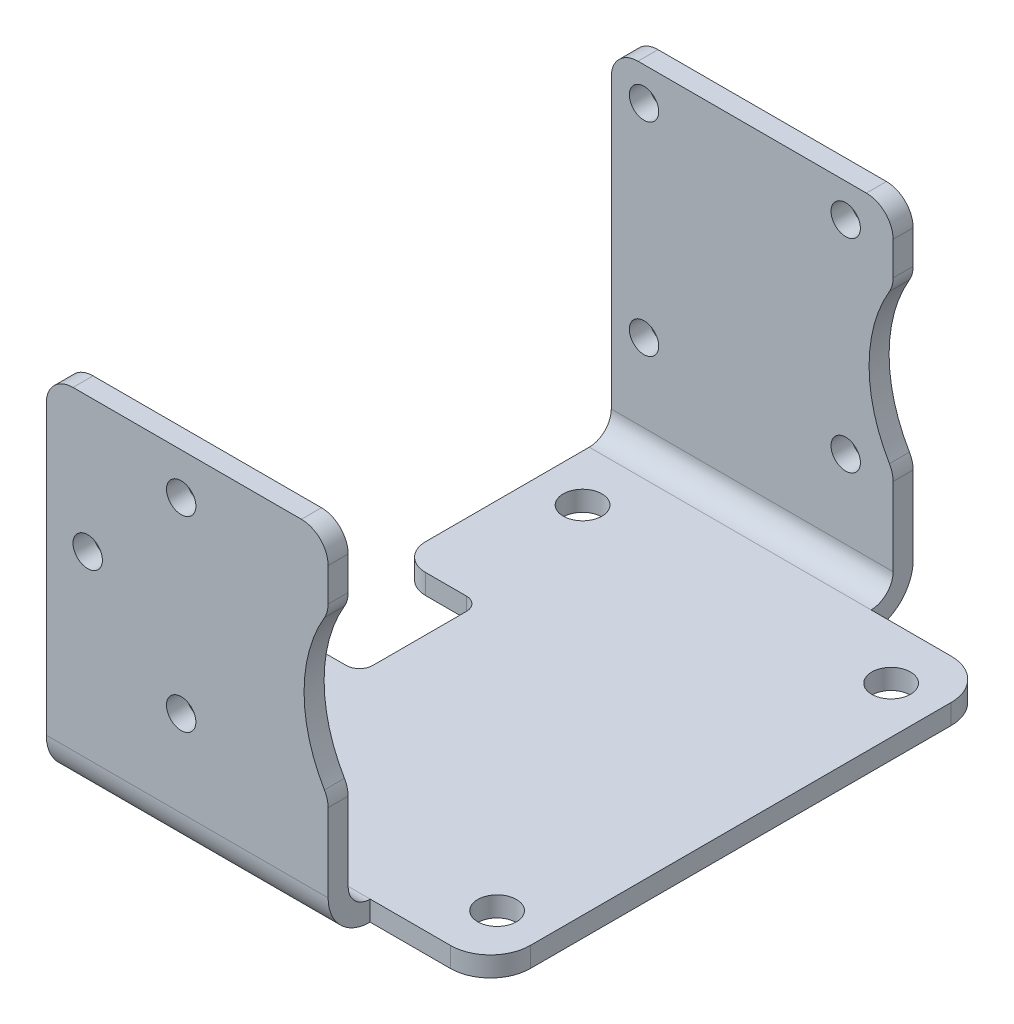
ISO-10303-21;
HEADER;
FILE_DESCRIPTION(('STEP AP214'),'2;1');
FILE_NAME('part.step','',(''),(''),'','','');
FILE_SCHEMA(('AUTOMOTIVE_DESIGN { 1 0 10303 214 1 1 1 1 }'));
ENDSEC;
DATA;
#1=APPLICATION_CONTEXT('core data for automotive mechanical design processes');
#2=APPLICATION_PROTOCOL_DEFINITION('international standard','automotive_design',2000,#1);
#3=PRODUCT_CONTEXT('',#1,'mechanical');
#4=PRODUCT('Part','Part','',(#3));
#5=PRODUCT_RELATED_PRODUCT_CATEGORY('part','',(#4));
#6=PRODUCT_DEFINITION_FORMATION('','',#4);
#7=PRODUCT_DEFINITION_CONTEXT('part definition',#1,'design');
#8=PRODUCT_DEFINITION('design','',#6,#7);
#9=PRODUCT_DEFINITION_SHAPE('','',#8);
#10=(LENGTH_UNIT() NAMED_UNIT(*) SI_UNIT(.MILLI.,.METRE.));
#11=(NAMED_UNIT(*) PLANE_ANGLE_UNIT() SI_UNIT($,.RADIAN.));
#12=(NAMED_UNIT(*) SI_UNIT($,.STERADIAN.) SOLID_ANGLE_UNIT());
#13=UNCERTAINTY_MEASURE_WITH_UNIT(LENGTH_MEASURE(1.E-05),#10,'distance_accuracy_value','');
#14=(GEOMETRIC_REPRESENTATION_CONTEXT(3) GLOBAL_UNCERTAINTY_ASSIGNED_CONTEXT((#13)) GLOBAL_UNIT_ASSIGNED_CONTEXT((#10,
#11,#12)) REPRESENTATION_CONTEXT('',''));
#15=CARTESIAN_POINT('',(0.,0.,0.));
#16=DIRECTION('',(0.,0.,1.));
#17=DIRECTION('',(1.,0.,0.));
#18=AXIS2_PLACEMENT_3D('',#15,#16,#17);
#19=CARTESIAN_POINT('',(-20.05,-1.5,20.4));
#20=DIRECTION('',(-1.,0.,0.));
#21=DIRECTION('',(0.,0.,1.));
#22=AXIS2_PLACEMENT_3D('',#19,#20,#21);
#23=PLANE('',#22);
#24=DIRECTION('',(0.,0.,1.));
#25=VECTOR('',#24,1.);
#26=CARTESIAN_POINT('',(-20.05,0.,20.4));
#27=LINE('',#26,#25);
#28=CARTESIAN_POINT('',(-20.05,0.,6.5));
#29=VERTEX_POINT('',#28);
#30=CARTESIAN_POINT('',(-20.05,0.,18.75));
#31=VERTEX_POINT('',#30);
#32=EDGE_CURVE('E588',#29,#31,#27,.T.);
#33=ORIENTED_EDGE('',*,*,#32,.F.);
#34=DIRECTION('',(0.,1.,0.));
#35=VECTOR('',#34,1.);
#36=CARTESIAN_POINT('',(-20.05,-1.5,6.5));
#37=LINE('',#36,#35);
#38=CARTESIAN_POINT('',(-20.05,-1.5,6.5));
#39=VERTEX_POINT('',#38);
#40=EDGE_CURVE('E12',#29,#39,#37,.F.);
#41=ORIENTED_EDGE('',*,*,#40,.T.);
#42=DIRECTION('',(0.,0.,1.));
#43=VECTOR('',#42,1.);
#44=CARTESIAN_POINT('',(-20.05,-1.5,20.4));
#45=LINE('',#44,#43);
#46=CARTESIAN_POINT('',(-20.05,-1.5,18.75));
#47=VERTEX_POINT('',#46);
#48=EDGE_CURVE('E594',#39,#47,#45,.T.);
#49=ORIENTED_EDGE('',*,*,#48,.T.);
#50=DIRECTION('',(0.,-1.,0.));
#51=VECTOR('',#50,1.);
#52=CARTESIAN_POINT('',(-20.05,0.,18.75));
#53=LINE('',#52,#51);
#54=EDGE_CURVE('E577',#31,#47,#53,.T.);
#55=ORIENTED_EDGE('',*,*,#54,.F.);
#56=EDGE_LOOP('',(#33,#41,#49,#55));
#57=FACE_BOUND('',#56,.T.);
#58=ADVANCED_FACE('F48',(#57),#23,.T.);
#59=CARTESIAN_POINT('',(0.,0.,21.9));
#60=DIRECTION('',(0.,0.,-1.));
#61=DIRECTION('',(-1.,0.,0.));
#62=AXIS2_PLACEMENT_3D('',#59,#60,#61);
#63=PLANE('',#62);
#64=DIRECTION('',(0.,-1.,0.));
#65=VECTOR('',#64,1.);
#66=CARTESIAN_POINT('',(1.05,-1.5,21.9));
#67=LINE('',#66,#65);
#68=CARTESIAN_POINT('',(1.05,7.50000000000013,21.9));
#69=VERTEX_POINT('',#68);
#70=CARTESIAN_POINT('',(1.05,1.64999999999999,21.9));
#71=VERTEX_POINT('',#70);
#72=EDGE_CURVE('E453',#69,#71,#67,.T.);
#73=ORIENTED_EDGE('',*,*,#72,.F.);
#74=CARTESIAN_POINT('',(-0.950000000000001,7.50000000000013,21.9));
#75=DIRECTION('',(0.,0.,-1.));
#76=DIRECTION('',(-1.,0.,0.));
#77=AXIS2_PLACEMENT_3D('',#74,#75,#76);
#78=CIRCLE('',#77,2.);
#79=CARTESIAN_POINT('',(0.773076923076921,8.51538461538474,21.9000000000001));
#80=VERTEX_POINT('',#79);
#81=EDGE_CURVE('E656',#69,#80,#78,.F.);
#82=ORIENTED_EDGE('',*,*,#81,.T.);
#83=CARTESIAN_POINT('',(10.25,14.1000000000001,21.9));
#84=DIRECTION('',(0.,0.,-1.));
#85=DIRECTION('',(0.,1.,0.));
#86=AXIS2_PLACEMENT_3D('',#83,#84,#85);
#87=CIRCLE('',#86,11.);
#88=CARTESIAN_POINT('',(0.773076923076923,19.6846153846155,21.9));
#89=VERTEX_POINT('',#88);
#90=EDGE_CURVE('E433',#80,#89,#87,.T.);
#91=ORIENTED_EDGE('',*,*,#90,.T.);
#92=CARTESIAN_POINT('',(-0.950000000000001,20.7000000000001,21.9));
#93=DIRECTION('',(0.,0.,-1.));
#94=DIRECTION('',(-1.,0.,0.));
#95=AXIS2_PLACEMENT_3D('',#92,#93,#94);
#96=CIRCLE('',#95,2.);
#97=CARTESIAN_POINT('',(1.05,20.7000000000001,21.9));
#98=VERTEX_POINT('',#97);
#99=EDGE_CURVE('E653',#89,#98,#96,.F.);
#100=ORIENTED_EDGE('',*,*,#99,.T.);
#101=CARTESIAN_POINT('',(1.05,23.2,21.9));
#102=VERTEX_POINT('',#101);
#103=EDGE_CURVE('E455',#102,#98,#67,.T.);
#104=ORIENTED_EDGE('',*,*,#103,.F.);
#105=CARTESIAN_POINT('',(-0.950000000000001,23.2,21.9));
#106=DIRECTION('',(0.,0.,-1.));
#107=DIRECTION('',(-1.,0.,0.));
#108=AXIS2_PLACEMENT_3D('',#105,#106,#107);
#109=CIRCLE('',#108,2.);
#110=CARTESIAN_POINT('',(-0.95,25.2,21.9));
#111=VERTEX_POINT('',#110);
#112=EDGE_CURVE('E647',#102,#111,#109,.F.);
#113=ORIENTED_EDGE('',*,*,#112,.T.);
#114=DIRECTION('',(-1.,0.,0.));
#115=VECTOR('',#114,1.);
#116=CARTESIAN_POINT('',(-20.05,25.2,21.9));
#117=LINE('',#116,#115);
#118=CARTESIAN_POINT('',(-18.05,25.2,21.9));
#119=VERTEX_POINT('',#118);
#120=EDGE_CURVE('E558',#111,#119,#117,.T.);
#121=ORIENTED_EDGE('',*,*,#120,.T.);
#122=CARTESIAN_POINT('',(-18.05,23.2,21.9));
#123=DIRECTION('',(0.,0.,-1.));
#124=DIRECTION('',(-1.,0.,0.));
#125=AXIS2_PLACEMENT_3D('',#122,#123,#124);
#126=CIRCLE('',#125,2.);
#127=CARTESIAN_POINT('',(-20.05,23.2,21.9));
#128=VERTEX_POINT('',#127);
#129=EDGE_CURVE('E650',#119,#128,#126,.F.);
#130=ORIENTED_EDGE('',*,*,#129,.T.);
#131=DIRECTION('',(0.,-1.,0.));
#132=VECTOR('',#131,1.);
#133=CARTESIAN_POINT('',(-20.05,0.,21.9));
#134=LINE('',#133,#132);
#135=CARTESIAN_POINT('',(-20.05,1.65,21.9));
#136=VERTEX_POINT('',#135);
#137=EDGE_CURVE('E555',#128,#136,#134,.T.);
#138=ORIENTED_EDGE('',*,*,#137,.T.);
#139=DIRECTION('',(-1.,0.,0.));
#140=VECTOR('',#139,1.);
#141=CARTESIAN_POINT('',(0.,1.65,21.9));
#142=LINE('',#141,#140);
#143=EDGE_CURVE('E547',#71,#136,#142,.T.);
#144=ORIENTED_EDGE('',*,*,#143,.F.);
#145=EDGE_LOOP('',(#73,#82,#91,#100,#104,#113,#121,#130,#138,#144));
#146=FACE_BOUND('',#145,.T.);
#147=CARTESIAN_POINT('',(-9.95,8.1,21.9));
#148=DIRECTION('',(0.,0.,1.));
#149=DIRECTION('',(1.,0.,0.));
#150=AXIS2_PLACEMENT_3D('',#147,#148,#149);
#151=CIRCLE('',#150,1.1);
#152=CARTESIAN_POINT('',(-8.85,8.1,21.9));
#153=VERTEX_POINT('',#152);
#154=EDGE_CURVE('E352',#153,#153,#151,.T.);
#155=ORIENTED_EDGE('',*,*,#154,.F.);
#156=EDGE_LOOP('',(#155));
#157=FACE_BOUND('',#156,.T.);
#158=CARTESIAN_POINT('',(-9.95,22.1,21.9));
#159=DIRECTION('',(0.,0.,1.));
#160=DIRECTION('',(1.,0.,0.));
#161=AXIS2_PLACEMENT_3D('',#158,#159,#160);
#162=CIRCLE('',#161,1.1);
#163=CARTESIAN_POINT('',(-8.85,22.1,21.9));
#164=VERTEX_POINT('',#163);
#165=EDGE_CURVE('E344',#164,#164,#162,.T.);
#166=ORIENTED_EDGE('',*,*,#165,.F.);
#167=EDGE_LOOP('',(#166));
#168=FACE_BOUND('',#167,.T.);
#169=CARTESIAN_POINT('',(-16.95,15.1,21.9));
#170=DIRECTION('',(0.,0.,1.));
#171=DIRECTION('',(1.,0.,0.));
#172=AXIS2_PLACEMENT_3D('',#169,#170,#171);
#173=CIRCLE('',#172,1.1);
#174=CARTESIAN_POINT('',(-15.85,15.1,21.9));
#175=VERTEX_POINT('',#174);
#176=EDGE_CURVE('E336',#175,#175,#173,.T.);
#177=ORIENTED_EDGE('',*,*,#176,.F.);
#178=EDGE_LOOP('',(#177));
#179=FACE_BOUND('',#178,.T.);
#180=ADVANCED_FACE('F1067',(#146,#157,#168,#179),#63,.F.);
#181=CARTESIAN_POINT('',(0.,0.,-21.9));
#182=DIRECTION('',(0.,0.,1.));
#183=DIRECTION('',(0.,-1.,0.));
#184=AXIS2_PLACEMENT_3D('',#181,#182,#183);
#185=PLANE('',#184);
#186=CARTESIAN_POINT('',(-2.5,7.50000000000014,-21.9));
#187=DIRECTION('',(0.,0.,-1.));
#188=DIRECTION('',(0.,1.,0.));
#189=AXIS2_PLACEMENT_3D('',#186,#187,#188);
#190=CIRCLE('',#189,1.1);
#191=CARTESIAN_POINT('',(-2.5,8.60000000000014,-21.9));
#192=VERTEX_POINT('',#191);
#193=EDGE_CURVE('E376',#192,#192,#190,.T.);
#194=ORIENTED_EDGE('',*,*,#193,.F.);
#195=EDGE_LOOP('',(#194));
#196=FACE_BOUND('',#195,.T.);
#197=CARTESIAN_POINT('',(10.25,14.1,-21.9000000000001));
#198=DIRECTION('',(0.,0.,-1.));
#199=DIRECTION('',(0.,1.,0.));
#200=AXIS2_PLACEMENT_3D('',#197,#198,#199);
#201=CIRCLE('',#200,11.);
#202=CARTESIAN_POINT('',(0.77307692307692,8.51538461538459,-21.9));
#203=VERTEX_POINT('',#202);
#204=CARTESIAN_POINT('',(0.773076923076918,19.6846153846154,-21.9000000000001));
#205=VERTEX_POINT('',#204);
#206=EDGE_CURVE('E429',#203,#205,#201,.T.);
#207=ORIENTED_EDGE('',*,*,#206,.F.);
#208=CARTESIAN_POINT('',(-0.950000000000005,7.49999999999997,-21.9));
#209=DIRECTION('',(0.,0.,1.));
#210=DIRECTION('',(0.,-1.,0.));
#211=AXIS2_PLACEMENT_3D('',#208,#209,#210);
#212=CIRCLE('',#211,2.);
#213=CARTESIAN_POINT('',(1.05,7.49999999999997,-21.9000000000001));
#214=VERTEX_POINT('',#213);
#215=EDGE_CURVE('E697',#203,#214,#212,.F.);
#216=ORIENTED_EDGE('',*,*,#215,.T.);
#217=DIRECTION('',(0.,1.,0.));
#218=VECTOR('',#217,1.);
#219=CARTESIAN_POINT('',(1.05,-1.5,-21.9000000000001));
#220=LINE('',#219,#218);
#221=CARTESIAN_POINT('',(1.05,1.65000000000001,-21.9000000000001));
#222=VERTEX_POINT('',#221);
#223=EDGE_CURVE('E464',#222,#214,#220,.T.);
#224=ORIENTED_EDGE('',*,*,#223,.F.);
#225=DIRECTION('',(1.,0.,0.));
#226=VECTOR('',#225,1.);
#227=CARTESIAN_POINT('',(0.,1.65000000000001,-21.9));
#228=LINE('',#227,#226);
#229=CARTESIAN_POINT('',(-20.05,1.65000000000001,-21.9));
#230=VERTEX_POINT('',#229);
#231=EDGE_CURVE('E501',#230,#222,#228,.T.);
#232=ORIENTED_EDGE('',*,*,#231,.F.);
#233=DIRECTION('',(0.,1.,0.));
#234=VECTOR('',#233,1.);
#235=CARTESIAN_POINT('',(-20.05,25.2,-21.9000000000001));
#236=LINE('',#235,#234);
#237=CARTESIAN_POINT('',(-20.05,23.2,-21.9000000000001));
#238=VERTEX_POINT('',#237);
#239=EDGE_CURVE('E506',#230,#238,#236,.T.);
#240=ORIENTED_EDGE('',*,*,#239,.T.);
#241=CARTESIAN_POINT('',(-18.05,23.2,-21.9000000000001));
#242=DIRECTION('',(0.,0.,1.));
#243=DIRECTION('',(0.,-1.,0.));
#244=AXIS2_PLACEMENT_3D('',#241,#242,#243);
#245=CIRCLE('',#244,2.);
#246=CARTESIAN_POINT('',(-18.05,25.2,-21.9000000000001));
#247=VERTEX_POINT('',#246);
#248=EDGE_CURVE('E688',#238,#247,#245,.F.);
#249=ORIENTED_EDGE('',*,*,#248,.T.);
#250=DIRECTION('',(1.,0.,0.));
#251=VECTOR('',#250,1.);
#252=CARTESIAN_POINT('',(20.05,25.2,-21.9000000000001));
#253=LINE('',#252,#251);
#254=CARTESIAN_POINT('',(-0.95,25.2,-21.9000000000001));
#255=VERTEX_POINT('',#254);
#256=EDGE_CURVE('E510',#247,#255,#253,.T.);
#257=ORIENTED_EDGE('',*,*,#256,.T.);
#258=CARTESIAN_POINT('',(-0.950000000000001,23.2,-21.9000000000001));
#259=DIRECTION('',(0.,0.,1.));
#260=DIRECTION('',(0.,-1.,0.));
#261=AXIS2_PLACEMENT_3D('',#258,#259,#260);
#262=CIRCLE('',#261,2.);
#263=CARTESIAN_POINT('',(1.05,23.2,-21.9000000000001));
#264=VERTEX_POINT('',#263);
#265=EDGE_CURVE('E691',#255,#264,#262,.F.);
#266=ORIENTED_EDGE('',*,*,#265,.T.);
#267=CARTESIAN_POINT('',(1.05,20.7,-21.9000000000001));
#268=VERTEX_POINT('',#267);
#269=EDGE_CURVE('E463',#268,#264,#220,.T.);
#270=ORIENTED_EDGE('',*,*,#269,.F.);
#271=CARTESIAN_POINT('',(-0.950000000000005,20.7,-21.9000000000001));
#272=DIRECTION('',(0.,0.,1.));
#273=DIRECTION('',(0.,-1.,0.));
#274=AXIS2_PLACEMENT_3D('',#271,#272,#273);
#275=CIRCLE('',#274,2.);
#276=EDGE_CURVE('E694',#268,#205,#275,.F.);
#277=ORIENTED_EDGE('',*,*,#276,.T.);
#278=EDGE_LOOP('',(#207,#216,#224,#232,#240,#249,#257,#266,#270,#277));
#279=FACE_BOUND('',#278,.T.);
#280=CARTESIAN_POINT('',(-17.6,7.5,-21.9));
#281=DIRECTION('',(0.,0.,-1.));
#282=DIRECTION('',(0.,1.,0.));
#283=AXIS2_PLACEMENT_3D('',#280,#281,#282);
#284=CIRCLE('',#283,1.1);
#285=CARTESIAN_POINT('',(-17.6,8.6,-21.9));
#286=VERTEX_POINT('',#285);
#287=EDGE_CURVE('E384',#286,#286,#284,.T.);
#288=ORIENTED_EDGE('',*,*,#287,.F.);
#289=EDGE_LOOP('',(#288));
#290=FACE_BOUND('',#289,.T.);
#291=CARTESIAN_POINT('',(-17.6,22.7,-21.9000000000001));
#292=DIRECTION('',(0.,0.,-1.));
#293=DIRECTION('',(0.,1.,0.));
#294=AXIS2_PLACEMENT_3D('',#291,#292,#293);
#295=CIRCLE('',#294,1.1);
#296=CARTESIAN_POINT('',(-17.6,23.8,-21.9000000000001));
#297=VERTEX_POINT('',#296);
#298=EDGE_CURVE('E368',#297,#297,#295,.T.);
#299=ORIENTED_EDGE('',*,*,#298,.F.);
#300=EDGE_LOOP('',(#299));
#301=FACE_BOUND('',#300,.T.);
#302=CARTESIAN_POINT('',(-2.5,22.6999999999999,-21.9000000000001));
#303=DIRECTION('',(0.,0.,-1.));
#304=DIRECTION('',(0.,1.,0.));
#305=AXIS2_PLACEMENT_3D('',#302,#303,#304);
#306=CIRCLE('',#305,1.1);
#307=CARTESIAN_POINT('',(-2.5,23.7999999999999,-21.9000000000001));
#308=VERTEX_POINT('',#307);
#309=EDGE_CURVE('E360',#308,#308,#306,.T.);
#310=ORIENTED_EDGE('',*,*,#309,.F.);
#311=EDGE_LOOP('',(#310));
#312=FACE_BOUND('',#311,.T.);
#313=ADVANCED_FACE('F1129',(#196,#279,#290,#301,#312),#185,.F.);
#314=CARTESIAN_POINT('',(1.05,0.,0.));
#315=DIRECTION('',(-1.,0.,0.));
#316=DIRECTION('',(0.,0.,1.));
#317=AXIS2_PLACEMENT_3D('',#314,#315,#316);
#318=PLANE('',#317);
#319=DIRECTION('',(0.,-1.,0.));
#320=VECTOR('',#319,1.);
#321=CARTESIAN_POINT('',(1.05,0.,-20.4));
#322=LINE('',#321,#320);
#323=CARTESIAN_POINT('',(1.05,23.2,-20.4000000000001));
#324=VERTEX_POINT('',#323);
#325=CARTESIAN_POINT('',(1.05,20.7,-20.4000000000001));
#326=VERTEX_POINT('',#325);
#327=EDGE_CURVE('E470',#324,#326,#322,.T.);
#328=ORIENTED_EDGE('',*,*,#327,.T.);
#329=DIRECTION('',(0.,0.,-1.));
#330=VECTOR('',#329,1.);
#331=CARTESIAN_POINT('',(1.05,20.7,0.));
#332=LINE('',#331,#330);
#333=EDGE_CURVE('E704',#326,#268,#332,.T.);
#334=ORIENTED_EDGE('',*,*,#333,.T.);
#335=ORIENTED_EDGE('',*,*,#269,.T.);
#336=DIRECTION('',(0.,0.,1.));
#337=VECTOR('',#336,1.);
#338=CARTESIAN_POINT('',(1.05,23.2000000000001,0.));
#339=LINE('',#338,#337);
#340=EDGE_CURVE('E700',#264,#324,#339,.T.);
#341=ORIENTED_EDGE('',*,*,#340,.T.);
#342=EDGE_LOOP('',(#328,#334,#335,#341));
#343=FACE_BOUND('',#342,.T.);
#344=ADVANCED_FACE('F1180',(#343),#318,.F.);
#345=CARTESIAN_POINT('',(1.05,0.,0.));
#346=DIRECTION('',(1.,0.,0.));
#347=DIRECTION('',(0.,0.,-1.));
#348=AXIS2_PLACEMENT_3D('',#345,#346,#347);
#349=PLANE('',#348);
#350=DIRECTION('',(0.,-1.,0.));
#351=VECTOR('',#350,1.);
#352=CARTESIAN_POINT('',(1.05,0.,20.4));
#353=LINE('',#352,#351);
#354=CARTESIAN_POINT('',(1.05,7.50000000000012,20.4));
#355=VERTEX_POINT('',#354);
#356=CARTESIAN_POINT('',(1.05,1.65,20.4));
#357=VERTEX_POINT('',#356);
#358=EDGE_CURVE('E481',#355,#357,#353,.T.);
#359=ORIENTED_EDGE('',*,*,#358,.F.);
#360=DIRECTION('',(0.,0.,1.));
#361=VECTOR('',#360,1.);
#362=CARTESIAN_POINT('',(1.05,7.50000000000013,21.9000000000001));
#363=LINE('',#362,#361);
#364=EDGE_CURVE('E644',#355,#69,#363,.T.);
#365=ORIENTED_EDGE('',*,*,#364,.T.);
#366=ORIENTED_EDGE('',*,*,#72,.T.);
#367=CARTESIAN_POINT('',(1.05,1.65,18.75));
#368=DIRECTION('',(1.,0.,0.));
#369=DIRECTION('',(0.,0.,-1.));
#370=AXIS2_PLACEMENT_3D('',#367,#368,#369);
#371=CIRCLE('',#370,3.15);
#372=CARTESIAN_POINT('',(1.05,-1.5,18.75));
#373=VERTEX_POINT('',#372);
#374=EDGE_CURVE('E490',#373,#71,#371,.F.);
#375=ORIENTED_EDGE('',*,*,#374,.F.);
#376=DIRECTION('',(0.,1.,0.));
#377=VECTOR('',#376,1.);
#378=CARTESIAN_POINT('',(1.05,-1.5,18.75));
#379=LINE('',#378,#377);
#380=CARTESIAN_POINT('',(1.05,0.,18.75));
#381=VERTEX_POINT('',#380);
#382=EDGE_CURVE('E449',#373,#381,#379,.T.);
#383=ORIENTED_EDGE('',*,*,#382,.T.);
#384=CARTESIAN_POINT('',(1.05,1.65,18.75));
#385=DIRECTION('',(1.,0.,0.));
#386=DIRECTION('',(0.,0.,-1.));
#387=AXIS2_PLACEMENT_3D('',#384,#385,#386);
#388=CIRCLE('',#387,1.65);
#389=EDGE_CURVE('E486',#381,#357,#388,.F.);
#390=ORIENTED_EDGE('',*,*,#389,.T.);
#391=EDGE_LOOP('',(#359,#365,#366,#375,#383,#390));
#392=FACE_BOUND('',#391,.T.);
#393=ADVANCED_FACE('F1110',(#392),#349,.T.);
#394=CARTESIAN_POINT('',(20.05,1.65,18.75));
#395=DIRECTION('',(1.,0.,0.));
#396=DIRECTION('',(0.,0.,1.));
#397=AXIS2_PLACEMENT_3D('',#394,#395,#396);
#398=CYLINDRICAL_SURFACE('',#397,3.15);
#399=DIRECTION('',(1.,0.,0.));
#400=VECTOR('',#399,1.);
#401=CARTESIAN_POINT('',(20.05,-1.5,18.75));
#402=LINE('',#401,#400);
#403=EDGE_CURVE('E573',#373,#47,#402,.F.);
#404=ORIENTED_EDGE('',*,*,#403,.F.);
#405=ORIENTED_EDGE('',*,*,#374,.T.);
#406=ORIENTED_EDGE('',*,*,#143,.T.);
#407=CARTESIAN_POINT('',(-20.05,1.65,18.75));
#408=DIRECTION('',(1.,0.,0.));
#409=DIRECTION('',(0.,0.,-1.));
#410=AXIS2_PLACEMENT_3D('',#407,#408,#409);
#411=CIRCLE('',#410,3.15);
#412=EDGE_CURVE('E572',#47,#136,#411,.F.);
#413=ORIENTED_EDGE('',*,*,#412,.F.);
#414=EDGE_LOOP('',(#404,#405,#406,#413));
#415=FACE_BOUND('',#414,.T.);
#416=ADVANCED_FACE('F1063',(#415),#398,.T.);
#417=CARTESIAN_POINT('',(20.05,1.65,18.75));
#418=DIRECTION('',(1.,0.,0.));
#419=DIRECTION('',(0.,0.,1.));
#420=AXIS2_PLACEMENT_3D('',#417,#418,#419);
#421=CYLINDRICAL_SURFACE('',#420,1.65);
#422=ORIENTED_EDGE('',*,*,#389,.F.);
#423=DIRECTION('',(1.,0.,0.));
#424=VECTOR('',#423,1.);
#425=CARTESIAN_POINT('',(20.05,0.,18.75));
#426=LINE('',#425,#424);
#427=EDGE_CURVE('E563',#381,#31,#426,.F.);
#428=ORIENTED_EDGE('',*,*,#427,.T.);
#429=CARTESIAN_POINT('',(-20.05,1.65,18.75));
#430=DIRECTION('',(1.,0.,0.));
#431=DIRECTION('',(0.,0.,-1.));
#432=AXIS2_PLACEMENT_3D('',#429,#430,#431);
#433=CIRCLE('',#432,1.65);
#434=CARTESIAN_POINT('',(-20.05,1.65,20.4));
#435=VERTEX_POINT('',#434);
#436=EDGE_CURVE('E578',#31,#435,#433,.F.);
#437=ORIENTED_EDGE('',*,*,#436,.T.);
#438=DIRECTION('',(1.,0.,0.));
#439=VECTOR('',#438,1.);
#440=CARTESIAN_POINT('',(-20.05,1.65,20.4));
#441=LINE('',#440,#439);
#442=EDGE_CURVE('E543',#435,#357,#441,.T.);
#443=ORIENTED_EDGE('',*,*,#442,.T.);
#444=EDGE_LOOP('',(#422,#428,#437,#443));
#445=FACE_BOUND('',#444,.T.);
#446=ADVANCED_FACE('F1115',(#445),#421,.F.);
#447=CARTESIAN_POINT('',(0.,0.,20.4));
#448=DIRECTION('',(0.,0.,-1.));
#449=DIRECTION('',(-1.,0.,0.));
#450=AXIS2_PLACEMENT_3D('',#447,#448,#449);
#451=PLANE('',#450);
#452=CARTESIAN_POINT('',(-16.95,15.1,20.4));
#453=DIRECTION('',(0.,0.,-1.));
#454=DIRECTION('',(-1.,0.,0.));
#455=AXIS2_PLACEMENT_3D('',#452,#453,#454);
#456=CIRCLE('',#455,1.1);
#457=CARTESIAN_POINT('',(-18.05,15.1,20.4));
#458=VERTEX_POINT('',#457);
#459=EDGE_CURVE('E340',#458,#458,#456,.T.);
#460=ORIENTED_EDGE('',*,*,#459,.F.);
#461=EDGE_LOOP('',(#460));
#462=FACE_BOUND('',#461,.T.);
#463=CARTESIAN_POINT('',(-9.95,22.1,20.4));
#464=DIRECTION('',(0.,0.,-1.));
#465=DIRECTION('',(-1.,0.,0.));
#466=AXIS2_PLACEMENT_3D('',#463,#464,#465);
#467=CIRCLE('',#466,1.1);
#468=CARTESIAN_POINT('',(-11.05,22.1,20.4));
#469=VERTEX_POINT('',#468);
#470=EDGE_CURVE('E348',#469,#469,#467,.T.);
#471=ORIENTED_EDGE('',*,*,#470,.F.);
#472=EDGE_LOOP('',(#471));
#473=FACE_BOUND('',#472,.T.);
#474=CARTESIAN_POINT('',(-9.95,8.1,20.4));
#475=DIRECTION('',(0.,0.,-1.));
#476=DIRECTION('',(-1.,0.,0.));
#477=AXIS2_PLACEMENT_3D('',#474,#475,#476);
#478=CIRCLE('',#477,1.1);
#479=CARTESIAN_POINT('',(-11.05,8.1,20.4));
#480=VERTEX_POINT('',#479);
#481=EDGE_CURVE('E356',#480,#480,#478,.T.);
#482=ORIENTED_EDGE('',*,*,#481,.F.);
#483=EDGE_LOOP('',(#482));
#484=FACE_BOUND('',#483,.T.);
#485=CARTESIAN_POINT('',(10.25,14.1000000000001,20.4));
#486=DIRECTION('',(0.,0.,-1.));
#487=DIRECTION('',(-1.,0.,0.));
#488=AXIS2_PLACEMENT_3D('',#485,#486,#487);
#489=CIRCLE('',#488,11.);
#490=CARTESIAN_POINT('',(0.773076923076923,8.51538461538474,20.4));
#491=VERTEX_POINT('',#490);
#492=CARTESIAN_POINT('',(0.773076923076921,19.6846153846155,20.4));
#493=VERTEX_POINT('',#492);
#494=EDGE_CURVE('E437',#491,#493,#489,.T.);
#495=ORIENTED_EDGE('',*,*,#494,.F.);
#496=CARTESIAN_POINT('',(-0.950000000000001,7.50000000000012,20.4));
#497=DIRECTION('',(0.,0.,-1.));
#498=DIRECTION('',(-1.,0.,0.));
#499=AXIS2_PLACEMENT_3D('',#496,#497,#498);
#500=CIRCLE('',#499,2.);
#501=EDGE_CURVE('E641',#491,#355,#500,.T.);
#502=ORIENTED_EDGE('',*,*,#501,.T.);
#503=ORIENTED_EDGE('',*,*,#358,.T.);
#504=ORIENTED_EDGE('',*,*,#442,.F.);
#505=DIRECTION('',(0.,-1.,0.));
#506=VECTOR('',#505,1.);
#507=CARTESIAN_POINT('',(-20.05,0.,20.4));
#508=LINE('',#507,#506);
#509=CARTESIAN_POINT('',(-20.05,23.2,20.4));
#510=VERTEX_POINT('',#509);
#511=EDGE_CURVE('E554',#510,#435,#508,.T.);
#512=ORIENTED_EDGE('',*,*,#511,.F.);
#513=CARTESIAN_POINT('',(-18.05,23.2,20.4));
#514=DIRECTION('',(0.,0.,-1.));
#515=DIRECTION('',(-1.,0.,0.));
#516=AXIS2_PLACEMENT_3D('',#513,#514,#515);
#517=CIRCLE('',#516,2.);
#518=CARTESIAN_POINT('',(-18.05,25.2,20.4));
#519=VERTEX_POINT('',#518);
#520=EDGE_CURVE('E635',#510,#519,#517,.T.);
#521=ORIENTED_EDGE('',*,*,#520,.T.);
#522=DIRECTION('',(-1.,0.,0.));
#523=VECTOR('',#522,1.);
#524=CARTESIAN_POINT('',(-20.05,25.2,20.4));
#525=LINE('',#524,#523);
#526=CARTESIAN_POINT('',(-0.95,25.2,20.4));
#527=VERTEX_POINT('',#526);
#528=EDGE_CURVE('E559',#527,#519,#525,.T.);
#529=ORIENTED_EDGE('',*,*,#528,.F.);
#530=CARTESIAN_POINT('',(-0.950000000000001,23.2,20.4));
#531=DIRECTION('',(0.,0.,-1.));
#532=DIRECTION('',(-1.,0.,0.));
#533=AXIS2_PLACEMENT_3D('',#530,#531,#532);
#534=CIRCLE('',#533,2.);
#535=CARTESIAN_POINT('',(1.05,23.2,20.4));
#536=VERTEX_POINT('',#535);
#537=EDGE_CURVE('E632',#527,#536,#534,.T.);
#538=ORIENTED_EDGE('',*,*,#537,.T.);
#539=CARTESIAN_POINT('',(1.05,20.7000000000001,20.4));
#540=VERTEX_POINT('',#539);
#541=EDGE_CURVE('E482',#536,#540,#353,.T.);
#542=ORIENTED_EDGE('',*,*,#541,.T.);
#543=CARTESIAN_POINT('',(-0.950000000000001,20.7000000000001,20.4));
#544=DIRECTION('',(0.,0.,-1.));
#545=DIRECTION('',(-1.,0.,0.));
#546=AXIS2_PLACEMENT_3D('',#543,#544,#545);
#547=CIRCLE('',#546,2.);
#548=EDGE_CURVE('E638',#540,#493,#547,.T.);
#549=ORIENTED_EDGE('',*,*,#548,.T.);
#550=EDGE_LOOP('',(#495,#502,#503,#504,#512,#521,#529,#538,#542,#549));
#551=FACE_BOUND('',#550,.T.);
#552=ADVANCED_FACE('F1082',(#462,#473,#484,#551),#451,.T.);
#553=CARTESIAN_POINT('',(-20.05,25.2,21.9));
#554=DIRECTION('',(0.,-1.,0.));
#555=DIRECTION('',(0.,0.,-1.));
#556=AXIS2_PLACEMENT_3D('',#553,#554,#555);
#557=PLANE('',#556);
#558=ORIENTED_EDGE('',*,*,#528,.T.);
#559=DIRECTION('',(0.,0.,-1.));
#560=VECTOR('',#559,1.);
#561=CARTESIAN_POINT('',(-18.05,25.2,21.9));
#562=LINE('',#561,#560);
#563=EDGE_CURVE('E725',#519,#119,#562,.F.);
#564=ORIENTED_EDGE('',*,*,#563,.T.);
#565=ORIENTED_EDGE('',*,*,#120,.F.);
#566=DIRECTION('',(0.,0.,1.));
#567=VECTOR('',#566,1.);
#568=CARTESIAN_POINT('',(-0.950000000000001,25.2,20.4));
#569=LINE('',#568,#567);
#570=EDGE_CURVE('E722',#111,#527,#569,.F.);
#571=ORIENTED_EDGE('',*,*,#570,.T.);
#572=EDGE_LOOP('',(#558,#564,#565,#571));
#573=FACE_BOUND('',#572,.T.);
#574=ADVANCED_FACE('F1086',(#573),#557,.F.);
#575=CARTESIAN_POINT('',(0.,-1.5,0.));
#576=DIRECTION('',(0.,1.,0.));
#577=DIRECTION('',(0.,0.,1.));
#578=AXIS2_PLACEMENT_3D('',#575,#576,#577);
#579=PLANE('',#578);
#580=CARTESIAN_POINT('',(-16.55,-1.50000000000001,-14.75));
#581=DIRECTION('',(0.,1.,0.));
#582=DIRECTION('',(0.,0.,1.));
#583=AXIS2_PLACEMENT_3D('',#580,#581,#582);
#584=CIRCLE('',#583,1.45);
#585=CARTESIAN_POINT('',(-16.55,-1.50000000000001,-13.3));
#586=VERTEX_POINT('',#585);
#587=EDGE_CURVE('E406',#586,#586,#584,.T.);
#588=ORIENTED_EDGE('',*,*,#587,.T.);
#589=EDGE_LOOP('',(#588));
#590=FACE_BOUND('',#589,.T.);
#591=CARTESIAN_POINT('',(6.55,-1.50000000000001,14.75));
#592=DIRECTION('',(0.,1.,0.));
#593=DIRECTION('',(0.,0.,1.));
#594=AXIS2_PLACEMENT_3D('',#591,#592,#593);
#595=CIRCLE('',#594,1.45);
#596=CARTESIAN_POINT('',(6.55,-1.50000000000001,16.2));
#597=VERTEX_POINT('',#596);
#598=EDGE_CURVE('E397',#597,#597,#595,.T.);
#599=ORIENTED_EDGE('',*,*,#598,.T.);
#600=EDGE_LOOP('',(#599));
#601=FACE_BOUND('',#600,.T.);
#602=CARTESIAN_POINT('',(-16.55,-1.50000000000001,14.75));
#603=DIRECTION('',(0.,1.,0.));
#604=DIRECTION('',(0.,0.,1.));
#605=AXIS2_PLACEMENT_3D('',#602,#603,#604);
#606=CIRCLE('',#605,1.45);
#607=CARTESIAN_POINT('',(-16.55,-1.50000000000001,16.2));
#608=VERTEX_POINT('',#607);
#609=EDGE_CURVE('E392',#608,#608,#606,.T.);
#610=ORIENTED_EDGE('',*,*,#609,.T.);
#611=EDGE_LOOP('',(#610));
#612=FACE_BOUND('',#611,.T.);
#613=CARTESIAN_POINT('',(6.55,-1.50000000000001,-14.75));
#614=DIRECTION('',(0.,1.,0.));
#615=DIRECTION('',(0.,0.,1.));
#616=AXIS2_PLACEMENT_3D('',#613,#614,#615);
#617=CIRCLE('',#616,1.45);
#618=CARTESIAN_POINT('',(6.55,-1.50000000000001,-13.3));
#619=VERTEX_POINT('',#618);
#620=EDGE_CURVE('E417',#619,#619,#617,.T.);
#621=ORIENTED_EDGE('',*,*,#620,.T.);
#622=EDGE_LOOP('',(#621));
#623=FACE_BOUND('',#622,.T.);
#624=DIRECTION('',(1.,0.,0.));
#625=VECTOR('',#624,1.);
#626=CARTESIAN_POINT('',(-20.05,-1.5,-4.5));
#627=LINE('',#626,#625);
#628=CARTESIAN_POINT('',(-18.05,-1.5,-4.5));
#629=VERTEX_POINT('',#628);
#630=CARTESIAN_POINT('',(-15.,-1.5,-4.5));
#631=VERTEX_POINT('',#630);
#632=EDGE_CURVE('E282',#629,#631,#627,.T.);
#633=ORIENTED_EDGE('',*,*,#632,.F.);
#634=CARTESIAN_POINT('',(-18.05,-1.5,-6.5));
#635=DIRECTION('',(0.,1.,0.));
#636=DIRECTION('',(0.,0.,1.));
#637=AXIS2_PLACEMENT_3D('',#634,#635,#636);
#638=CIRCLE('',#637,2.);
#639=CARTESIAN_POINT('',(-20.05,-1.5,-6.5));
#640=VERTEX_POINT('',#639);
#641=EDGE_CURVE('E741',#629,#640,#638,.F.);
#642=ORIENTED_EDGE('',*,*,#641,.T.);
#643=CARTESIAN_POINT('',(-20.05,-1.50000000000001,-18.75));
#644=VERTEX_POINT('',#643);
#645=EDGE_CURVE('E589',#644,#640,#45,.T.);
#646=ORIENTED_EDGE('',*,*,#645,.F.);
#647=DIRECTION('',(-1.,0.,0.));
#648=VECTOR('',#647,1.);
#649=CARTESIAN_POINT('',(-20.05,-1.50000000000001,-18.75));
#650=LINE('',#649,#648);
#651=CARTESIAN_POINT('',(1.05,-1.5,-18.75));
#652=VERTEX_POINT('',#651);
#653=EDGE_CURVE('E522',#644,#652,#650,.F.);
#654=ORIENTED_EDGE('',*,*,#653,.T.);
#655=DIRECTION('',(1.,0.,0.));
#656=VECTOR('',#655,1.);
#657=CARTESIAN_POINT('',(1.05,-1.5,-18.75));
#658=LINE('',#657,#656);
#659=CARTESIAN_POINT('',(7.05,-1.5,-18.75));
#660=VERTEX_POINT('',#659);
#661=EDGE_CURVE('E448',#652,#660,#658,.T.);
#662=ORIENTED_EDGE('',*,*,#661,.T.);
#663=CARTESIAN_POINT('',(7.05,-1.5,-15.75));
#664=DIRECTION('',(0.,1.,0.));
#665=DIRECTION('',(0.,0.,1.));
#666=AXIS2_PLACEMENT_3D('',#663,#664,#665);
#667=CIRCLE('',#666,3.);
#668=CARTESIAN_POINT('',(10.05,-1.50000000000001,-15.75));
#669=VERTEX_POINT('',#668);
#670=EDGE_CURVE('E617',#660,#669,#667,.F.);
#671=ORIENTED_EDGE('',*,*,#670,.T.);
#672=DIRECTION('',(0.,0.,1.));
#673=VECTOR('',#672,1.);
#674=CARTESIAN_POINT('',(10.05,-1.50000000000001,-18.75));
#675=LINE('',#674,#673);
#676=CARTESIAN_POINT('',(10.05,-1.50000000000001,15.75));
#677=VERTEX_POINT('',#676);
#678=EDGE_CURVE('E425',#669,#677,#675,.T.);
#679=ORIENTED_EDGE('',*,*,#678,.T.);
#680=CARTESIAN_POINT('',(7.05,-1.5,15.75));
#681=DIRECTION('',(0.,1.,0.));
#682=DIRECTION('',(0.,0.,1.));
#683=AXIS2_PLACEMENT_3D('',#680,#681,#682);
#684=CIRCLE('',#683,3.);
#685=CARTESIAN_POINT('',(7.05,-1.5,18.75));
#686=VERTEX_POINT('',#685);
#687=EDGE_CURVE('E614',#677,#686,#684,.F.);
#688=ORIENTED_EDGE('',*,*,#687,.T.);
#689=EDGE_CURVE('E569',#686,#373,#402,.F.);
#690=ORIENTED_EDGE('',*,*,#689,.T.);
#691=ORIENTED_EDGE('',*,*,#403,.T.);
#692=ORIENTED_EDGE('',*,*,#48,.F.);
#693=CARTESIAN_POINT('',(-18.05,-1.5,6.5));
#694=DIRECTION('',(0.,1.,0.));
#695=DIRECTION('',(0.,0.,1.));
#696=AXIS2_PLACEMENT_3D('',#693,#694,#695);
#697=CIRCLE('',#696,2.);
#698=CARTESIAN_POINT('',(-18.05,-1.5,4.5));
#699=VERTEX_POINT('',#698);
#700=EDGE_CURVE('E738',#39,#699,#697,.F.);
#701=ORIENTED_EDGE('',*,*,#700,.T.);
#702=DIRECTION('',(-1.,0.,0.));
#703=VECTOR('',#702,1.);
#704=CARTESIAN_POINT('',(-15.,-1.5,4.5));
#705=LINE('',#704,#703);
#706=CARTESIAN_POINT('',(-15.,-1.5,4.5));
#707=VERTEX_POINT('',#706);
#708=EDGE_CURVE('E294',#707,#699,#705,.T.);
#709=ORIENTED_EDGE('',*,*,#708,.F.);
#710=CARTESIAN_POINT('',(-15.,-1.5,3.5));
#711=DIRECTION('',(0.,-1.,0.));
#712=DIRECTION('',(0.,0.,-1.));
#713=AXIS2_PLACEMENT_3D('',#710,#711,#712);
#714=CIRCLE('',#713,1.);
#715=CARTESIAN_POINT('',(-14.,-1.5,3.5));
#716=VERTEX_POINT('',#715);
#717=EDGE_CURVE('E305',#716,#707,#714,.T.);
#718=ORIENTED_EDGE('',*,*,#717,.F.);
#719=DIRECTION('',(0.,0.,1.));
#720=VECTOR('',#719,1.);
#721=CARTESIAN_POINT('',(-14.,-1.5,-3.5));
#722=LINE('',#721,#720);
#723=CARTESIAN_POINT('',(-14.,-1.5,-3.5));
#724=VERTEX_POINT('',#723);
#725=EDGE_CURVE('E310',#724,#716,#722,.T.);
#726=ORIENTED_EDGE('',*,*,#725,.F.);
#727=CARTESIAN_POINT('',(-15.,-1.5,-3.5));
#728=DIRECTION('',(0.,-1.,0.));
#729=DIRECTION('',(0.,0.,-1.));
#730=AXIS2_PLACEMENT_3D('',#727,#728,#729);
#731=CIRCLE('',#730,1.);
#732=EDGE_CURVE('E293',#631,#724,#731,.T.);
#733=ORIENTED_EDGE('',*,*,#732,.F.);
#734=EDGE_LOOP('',(#633,#642,#646,#654,#662,#671,#679,#688,#690,#691,#692,#701,#709,#718,#726,#733));
#735=FACE_BOUND('',#734,.T.);
#736=ADVANCED_FACE('F307',(#590,#601,#612,#623,#735),#579,.F.);
#737=CARTESIAN_POINT('',(0.,0.,0.));
#738=DIRECTION('',(0.,1.,0.));
#739=DIRECTION('',(0.,0.,1.));
#740=AXIS2_PLACEMENT_3D('',#737,#738,#739);
#741=PLANE('',#740);
#742=CARTESIAN_POINT('',(-20.05,0.,-18.75));
#743=VERTEX_POINT('',#742);
#744=CARTESIAN_POINT('',(-20.05,0.,-6.5));
#745=VERTEX_POINT('',#744);
#746=EDGE_CURVE('E595',#743,#745,#27,.T.);
#747=ORIENTED_EDGE('',*,*,#746,.T.);
#748=CARTESIAN_POINT('',(-18.05,0.,-6.5));
#749=DIRECTION('',(0.,1.,0.));
#750=DIRECTION('',(0.,0.,1.));
#751=AXIS2_PLACEMENT_3D('',#748,#749,#750);
#752=CIRCLE('',#751,2.);
#753=CARTESIAN_POINT('',(-18.05,0.,-4.5));
#754=VERTEX_POINT('',#753);
#755=EDGE_CURVE('E749',#745,#754,#752,.T.);
#756=ORIENTED_EDGE('',*,*,#755,.T.);
#757=DIRECTION('',(-1.,0.,0.));
#758=VECTOR('',#757,1.);
#759=CARTESIAN_POINT('',(0.,0.,-4.5));
#760=LINE('',#759,#758);
#761=CARTESIAN_POINT('',(-15.,0.,-4.5));
#762=VERTEX_POINT('',#761);
#763=EDGE_CURVE('E325',#762,#754,#760,.T.);
#764=ORIENTED_EDGE('',*,*,#763,.F.);
#765=CARTESIAN_POINT('',(-15.,0.,-3.5));
#766=DIRECTION('',(0.,1.,0.));
#767=DIRECTION('',(0.,0.,1.));
#768=AXIS2_PLACEMENT_3D('',#765,#766,#767);
#769=CIRCLE('',#768,1.);
#770=CARTESIAN_POINT('',(-14.,0.,-3.5));
#771=VERTEX_POINT('',#770);
#772=EDGE_CURVE('E302',#771,#762,#769,.T.);
#773=ORIENTED_EDGE('',*,*,#772,.F.);
#774=DIRECTION('',(0.,0.,-1.));
#775=VECTOR('',#774,1.);
#776=CARTESIAN_POINT('',(-14.,0.,0.));
#777=LINE('',#776,#775);
#778=CARTESIAN_POINT('',(-14.,0.,3.5));
#779=VERTEX_POINT('',#778);
#780=EDGE_CURVE('E730',#779,#771,#777,.T.);
#781=ORIENTED_EDGE('',*,*,#780,.F.);
#782=CARTESIAN_POINT('',(-15.,0.,3.5));
#783=DIRECTION('',(0.,1.,0.));
#784=DIRECTION('',(0.,0.,1.));
#785=AXIS2_PLACEMENT_3D('',#782,#783,#784);
#786=CIRCLE('',#785,1.);
#787=CARTESIAN_POINT('',(-15.,0.,4.5));
#788=VERTEX_POINT('',#787);
#789=EDGE_CURVE('E733',#788,#779,#786,.T.);
#790=ORIENTED_EDGE('',*,*,#789,.F.);
#791=DIRECTION('',(1.,0.,0.));
#792=VECTOR('',#791,1.);
#793=CARTESIAN_POINT('',(0.,0.,4.5));
#794=LINE('',#793,#792);
#795=CARTESIAN_POINT('',(-18.05,0.,4.5));
#796=VERTEX_POINT('',#795);
#797=EDGE_CURVE('E333',#796,#788,#794,.T.);
#798=ORIENTED_EDGE('',*,*,#797,.F.);
#799=CARTESIAN_POINT('',(-18.05,0.,6.5));
#800=DIRECTION('',(0.,1.,0.));
#801=DIRECTION('',(0.,0.,1.));
#802=AXIS2_PLACEMENT_3D('',#799,#800,#801);
#803=CIRCLE('',#802,2.);
#804=EDGE_CURVE('E64',#796,#29,#803,.T.);
#805=ORIENTED_EDGE('',*,*,#804,.T.);
#806=ORIENTED_EDGE('',*,*,#32,.T.);
#807=ORIENTED_EDGE('',*,*,#427,.F.);
#808=CARTESIAN_POINT('',(7.05,0.,18.75));
#809=VERTEX_POINT('',#808);
#810=EDGE_CURVE('E582',#809,#381,#426,.F.);
#811=ORIENTED_EDGE('',*,*,#810,.F.);
#812=CARTESIAN_POINT('',(7.05,0.,15.75));
#813=DIRECTION('',(0.,1.,0.));
#814=DIRECTION('',(0.,0.,1.));
#815=AXIS2_PLACEMENT_3D('',#812,#813,#814);
#816=CIRCLE('',#815,3.);
#817=CARTESIAN_POINT('',(10.05,0.,15.75));
#818=VERTEX_POINT('',#817);
#819=EDGE_CURVE('E605',#809,#818,#816,.T.);
#820=ORIENTED_EDGE('',*,*,#819,.T.);
#821=DIRECTION('',(0.,0.,1.));
#822=VECTOR('',#821,1.);
#823=CARTESIAN_POINT('',(10.05,0.,-18.75));
#824=LINE('',#823,#822);
#825=CARTESIAN_POINT('',(10.05,0.,-15.75));
#826=VERTEX_POINT('',#825);
#827=EDGE_CURVE('E421',#826,#818,#824,.T.);
#828=ORIENTED_EDGE('',*,*,#827,.F.);
#829=CARTESIAN_POINT('',(7.05,0.,-15.75));
#830=DIRECTION('',(0.,1.,0.));
#831=DIRECTION('',(0.,0.,1.));
#832=AXIS2_PLACEMENT_3D('',#829,#830,#831);
#833=CIRCLE('',#832,3.);
#834=CARTESIAN_POINT('',(7.05,0.,-18.75));
#835=VERTEX_POINT('',#834);
#836=EDGE_CURVE('E608',#826,#835,#833,.T.);
#837=ORIENTED_EDGE('',*,*,#836,.T.);
#838=DIRECTION('',(-1.,0.,0.));
#839=VECTOR('',#838,1.);
#840=CARTESIAN_POINT('',(-20.05,0.,-18.75));
#841=LINE('',#840,#839);
#842=CARTESIAN_POINT('',(1.05,0.,-18.75));
#843=VERTEX_POINT('',#842);
#844=EDGE_CURVE('E535',#843,#835,#841,.F.);
#845=ORIENTED_EDGE('',*,*,#844,.F.);
#846=EDGE_CURVE('E531',#743,#843,#841,.F.);
#847=ORIENTED_EDGE('',*,*,#846,.F.);
#848=EDGE_LOOP('',(#747,#756,#764,#773,#781,#790,#798,#805,#806,#807,#811,#820,#828,#837,#845,#847));
#849=FACE_BOUND('',#848,.T.);
#850=CARTESIAN_POINT('',(-16.55,0.,-14.75));
#851=DIRECTION('',(0.,1.,0.));
#852=DIRECTION('',(0.,0.,1.));
#853=AXIS2_PLACEMENT_3D('',#850,#851,#852);
#854=CIRCLE('',#853,1.45);
#855=CARTESIAN_POINT('',(-16.55,0.,-13.3));
#856=VERTEX_POINT('',#855);
#857=EDGE_CURVE('E401',#856,#856,#854,.T.);
#858=ORIENTED_EDGE('',*,*,#857,.F.);
#859=EDGE_LOOP('',(#858));
#860=FACE_BOUND('',#859,.T.);
#861=CARTESIAN_POINT('',(6.55,0.,14.75));
#862=DIRECTION('',(0.,1.,0.));
#863=DIRECTION('',(0.,0.,1.));
#864=AXIS2_PLACEMENT_3D('',#861,#862,#863);
#865=CIRCLE('',#864,1.45);
#866=CARTESIAN_POINT('',(6.55,0.,16.2));
#867=VERTEX_POINT('',#866);
#868=EDGE_CURVE('E410',#867,#867,#865,.T.);
#869=ORIENTED_EDGE('',*,*,#868,.F.);
#870=EDGE_LOOP('',(#869));
#871=FACE_BOUND('',#870,.T.);
#872=CARTESIAN_POINT('',(-16.55,0.,14.75));
#873=DIRECTION('',(0.,1.,0.));
#874=DIRECTION('',(0.,0.,1.));
#875=AXIS2_PLACEMENT_3D('',#872,#873,#874);
#876=CIRCLE('',#875,1.45);
#877=CARTESIAN_POINT('',(-16.55,0.,16.2));
#878=VERTEX_POINT('',#877);
#879=EDGE_CURVE('E393',#878,#878,#876,.T.);
#880=ORIENTED_EDGE('',*,*,#879,.F.);
#881=EDGE_LOOP('',(#880));
#882=FACE_BOUND('',#881,.T.);
#883=CARTESIAN_POINT('',(6.55,0.,-14.75));
#884=DIRECTION('',(0.,1.,0.));
#885=DIRECTION('',(0.,0.,1.));
#886=AXIS2_PLACEMENT_3D('',#883,#884,#885);
#887=CIRCLE('',#886,1.45);
#888=CARTESIAN_POINT('',(6.55,0.,-13.3));
#889=VERTEX_POINT('',#888);
#890=EDGE_CURVE('E405',#889,#889,#887,.T.);
#891=ORIENTED_EDGE('',*,*,#890,.F.);
#892=EDGE_LOOP('',(#891));
#893=FACE_BOUND('',#892,.T.);
#894=ADVANCED_FACE('F761',(#849,#860,#871,#882,#893),#741,.T.);
#895=ORIENTED_EDGE('',*,*,#645,.T.);
#896=DIRECTION('',(0.,-1.,0.));
#897=VECTOR('',#896,1.);
#898=CARTESIAN_POINT('',(-20.05,0.,-6.5));
#899=LINE('',#898,#897);
#900=EDGE_CURVE('E744',#640,#745,#899,.F.);
#901=ORIENTED_EDGE('',*,*,#900,.T.);
#902=ORIENTED_EDGE('',*,*,#746,.F.);
#903=DIRECTION('',(0.,-1.,0.));
#904=VECTOR('',#903,1.);
#905=CARTESIAN_POINT('',(-20.05,0.,-18.75));
#906=LINE('',#905,#904);
#907=EDGE_CURVE('E526',#743,#644,#906,.T.);
#908=ORIENTED_EDGE('',*,*,#907,.T.);
#909=EDGE_LOOP('',(#895,#901,#902,#908));
#910=FACE_BOUND('',#909,.T.);
#911=ADVANCED_FACE('F1125',(#910),#23,.T.);
#912=CARTESIAN_POINT('',(-20.05,1.65,18.75));
#913=DIRECTION('',(-1.,0.,0.));
#914=DIRECTION('',(0.,0.,1.));
#915=AXIS2_PLACEMENT_3D('',#912,#913,#914);
#916=PLANE('',#915);
#917=DIRECTION('',(0.,0.,1.));
#918=VECTOR('',#917,1.);
#919=CARTESIAN_POINT('',(-20.05,1.65,20.4));
#920=LINE('',#919,#918);
#921=EDGE_CURVE('E542',#435,#136,#920,.T.);
#922=ORIENTED_EDGE('',*,*,#921,.F.);
#923=ORIENTED_EDGE('',*,*,#436,.F.);
#924=ORIENTED_EDGE('',*,*,#54,.T.);
#925=ORIENTED_EDGE('',*,*,#412,.T.);
#926=EDGE_LOOP('',(#922,#923,#924,#925));
#927=FACE_BOUND('',#926,.T.);
#928=ADVANCED_FACE('F1062',(#927),#916,.T.);
#929=CARTESIAN_POINT('',(-20.05,0.,21.9));
#930=DIRECTION('',(1.,0.,0.));
#931=DIRECTION('',(0.,1.,0.));
#932=AXIS2_PLACEMENT_3D('',#929,#930,#931);
#933=PLANE('',#932);
#934=ORIENTED_EDGE('',*,*,#137,.F.);
#935=DIRECTION('',(0.,0.,-1.));
#936=VECTOR('',#935,1.);
#937=CARTESIAN_POINT('',(-20.05,23.2,21.9));
#938=LINE('',#937,#936);
#939=EDGE_CURVE('E718',#128,#510,#938,.T.);
#940=ORIENTED_EDGE('',*,*,#939,.T.);
#941=ORIENTED_EDGE('',*,*,#511,.T.);
#942=ORIENTED_EDGE('',*,*,#921,.T.);
#943=EDGE_LOOP('',(#934,#940,#941,#942));
#944=FACE_BOUND('',#943,.T.);
#945=ADVANCED_FACE('F1074',(#944),#933,.F.);
#946=CARTESIAN_POINT('',(-20.05,1.64999999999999,-18.75));
#947=DIRECTION('',(1.,0.,0.));
#948=DIRECTION('',(0.,1.,0.));
#949=AXIS2_PLACEMENT_3D('',#946,#947,#948);
#950=PLANE('',#949);
#951=CARTESIAN_POINT('',(-20.05,1.64999999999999,-18.75));
#952=DIRECTION('',(-1.,0.,0.));
#953=DIRECTION('',(0.,-1.,0.));
#954=AXIS2_PLACEMENT_3D('',#951,#952,#953);
#955=CIRCLE('',#954,1.65);
#956=CARTESIAN_POINT('',(-20.05,1.64999999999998,-20.4));
#957=VERTEX_POINT('',#956);
#958=EDGE_CURVE('E515',#957,#743,#955,.T.);
#959=ORIENTED_EDGE('',*,*,#958,.F.);
#960=DIRECTION('',(0.,0.,-1.));
#961=VECTOR('',#960,1.);
#962=CARTESIAN_POINT('',(-20.05,1.65,-20.4));
#963=LINE('',#962,#961);
#964=EDGE_CURVE('E497',#957,#230,#963,.T.);
#965=ORIENTED_EDGE('',*,*,#964,.T.);
#966=CARTESIAN_POINT('',(-20.05,1.64999999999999,-18.75));
#967=DIRECTION('',(-1.,0.,0.));
#968=DIRECTION('',(0.,-1.,0.));
#969=AXIS2_PLACEMENT_3D('',#966,#967,#968);
#970=CIRCLE('',#969,3.15);
#971=EDGE_CURVE('E527',#230,#644,#970,.T.);
#972=ORIENTED_EDGE('',*,*,#971,.T.);
#973=ORIENTED_EDGE('',*,*,#907,.F.);
#974=EDGE_LOOP('',(#959,#965,#972,#973));
#975=FACE_BOUND('',#974,.T.);
#976=ADVANCED_FACE('F1148',(#975),#950,.F.);
#977=CARTESIAN_POINT('',(-20.05,1.64999999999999,-18.75));
#978=DIRECTION('',(-1.,0.,0.));
#979=DIRECTION('',(0.,0.,-1.));
#980=AXIS2_PLACEMENT_3D('',#977,#978,#979);
#981=CYLINDRICAL_SURFACE('',#980,3.15);
#982=CARTESIAN_POINT('',(1.05,1.64999999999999,-18.75));
#983=DIRECTION('',(-1.,0.,0.));
#984=DIRECTION('',(0.,0.,1.));
#985=AXIS2_PLACEMENT_3D('',#982,#983,#984);
#986=CIRCLE('',#985,3.15);
#987=EDGE_CURVE('E478',#652,#222,#986,.F.);
#988=ORIENTED_EDGE('',*,*,#987,.F.);
#989=ORIENTED_EDGE('',*,*,#653,.F.);
#990=ORIENTED_EDGE('',*,*,#971,.F.);
#991=ORIENTED_EDGE('',*,*,#231,.T.);
#992=EDGE_LOOP('',(#988,#989,#990,#991));
#993=FACE_BOUND('',#992,.T.);
#994=ADVANCED_FACE('F1202',(#993),#981,.T.);
#995=CARTESIAN_POINT('',(-20.05,1.64999999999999,-18.75));
#996=DIRECTION('',(-1.,0.,0.));
#997=DIRECTION('',(0.,0.,-1.));
#998=AXIS2_PLACEMENT_3D('',#995,#996,#997);
#999=CYLINDRICAL_SURFACE('',#998,1.65);
#1000=ORIENTED_EDGE('',*,*,#846,.T.);
#1001=CARTESIAN_POINT('',(1.05,1.64999999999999,-18.75));
#1002=DIRECTION('',(-1.,0.,0.));
#1003=DIRECTION('',(0.,0.,1.));
#1004=AXIS2_PLACEMENT_3D('',#1001,#1002,#1003);
#1005=CIRCLE('',#1004,1.65);
#1006=CARTESIAN_POINT('',(1.05,1.65,-20.4));
#1007=VERTEX_POINT('',#1006);
#1008=EDGE_CURVE('E474',#843,#1007,#1005,.F.);
#1009=ORIENTED_EDGE('',*,*,#1008,.T.);
#1010=DIRECTION('',(-1.,0.,0.));
#1011=VECTOR('',#1010,1.);
#1012=CARTESIAN_POINT('',(20.05,1.65,-20.4));
#1013=LINE('',#1012,#1011);
#1014=EDGE_CURVE('E494',#1007,#957,#1013,.T.);
#1015=ORIENTED_EDGE('',*,*,#1014,.T.);
#1016=ORIENTED_EDGE('',*,*,#958,.T.);
#1017=EDGE_LOOP('',(#1000,#1009,#1015,#1016));
#1018=FACE_BOUND('',#1017,.T.);
#1019=ADVANCED_FACE('F1151',(#1018),#999,.F.);
#1020=CARTESIAN_POINT('',(-20.05,25.2,-21.9000000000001));
#1021=DIRECTION('',(1.,0.,0.));
#1022=DIRECTION('',(0.,0.,-1.));
#1023=AXIS2_PLACEMENT_3D('',#1020,#1021,#1022);
#1024=PLANE('',#1023);
#1025=DIRECTION('',(0.,1.,0.));
#1026=VECTOR('',#1025,1.);
#1027=CARTESIAN_POINT('',(-20.05,25.2,-20.4000000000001));
#1028=LINE('',#1027,#1026);
#1029=CARTESIAN_POINT('',(-20.05,23.2,-20.4000000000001));
#1030=VERTEX_POINT('',#1029);
#1031=EDGE_CURVE('E505',#957,#1030,#1028,.T.);
#1032=ORIENTED_EDGE('',*,*,#1031,.T.);
#1033=DIRECTION('',(0.,0.,1.));
#1034=VECTOR('',#1033,1.);
#1035=CARTESIAN_POINT('',(-20.05,23.2,-21.9000000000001));
#1036=LINE('',#1035,#1034);
#1037=EDGE_CURVE('E715',#1030,#238,#1036,.F.);
#1038=ORIENTED_EDGE('',*,*,#1037,.T.);
#1039=ORIENTED_EDGE('',*,*,#239,.F.);
#1040=ORIENTED_EDGE('',*,*,#964,.F.);
#1041=EDGE_LOOP('',(#1032,#1038,#1039,#1040));
#1042=FACE_BOUND('',#1041,.T.);
#1043=ADVANCED_FACE('F1160',(#1042),#1024,.F.);
#1044=CARTESIAN_POINT('',(0.,0.,-20.4));
#1045=DIRECTION('',(0.,0.,1.));
#1046=DIRECTION('',(0.,-1.,0.));
#1047=AXIS2_PLACEMENT_3D('',#1044,#1045,#1046);
#1048=PLANE('',#1047);
#1049=CARTESIAN_POINT('',(-2.5,22.6999999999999,-20.4000000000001));
#1050=DIRECTION('',(0.,0.,1.));
#1051=DIRECTION('',(0.,-1.,0.));
#1052=AXIS2_PLACEMENT_3D('',#1049,#1050,#1051);
#1053=CIRCLE('',#1052,1.1);
#1054=CARTESIAN_POINT('',(-2.5,21.5999999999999,-20.4000000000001));
#1055=VERTEX_POINT('',#1054);
#1056=EDGE_CURVE('E364',#1055,#1055,#1053,.T.);
#1057=ORIENTED_EDGE('',*,*,#1056,.F.);
#1058=EDGE_LOOP('',(#1057));
#1059=FACE_BOUND('',#1058,.T.);
#1060=CARTESIAN_POINT('',(-17.6,22.7,-20.4000000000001));
#1061=DIRECTION('',(0.,0.,1.));
#1062=DIRECTION('',(0.,-1.,0.));
#1063=AXIS2_PLACEMENT_3D('',#1060,#1061,#1062);
#1064=CIRCLE('',#1063,1.1);
#1065=CARTESIAN_POINT('',(-17.6,21.6,-20.4000000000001));
#1066=VERTEX_POINT('',#1065);
#1067=EDGE_CURVE('E372',#1066,#1066,#1064,.T.);
#1068=ORIENTED_EDGE('',*,*,#1067,.F.);
#1069=EDGE_LOOP('',(#1068));
#1070=FACE_BOUND('',#1069,.T.);
#1071=CARTESIAN_POINT('',(-2.5,7.50000000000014,-20.4));
#1072=DIRECTION('',(0.,0.,1.));
#1073=DIRECTION('',(0.,-1.,0.));
#1074=AXIS2_PLACEMENT_3D('',#1071,#1072,#1073);
#1075=CIRCLE('',#1074,1.1);
#1076=CARTESIAN_POINT('',(-2.5,6.40000000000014,-20.4));
#1077=VERTEX_POINT('',#1076);
#1078=EDGE_CURVE('E380',#1077,#1077,#1075,.T.);
#1079=ORIENTED_EDGE('',*,*,#1078,.F.);
#1080=EDGE_LOOP('',(#1079));
#1081=FACE_BOUND('',#1080,.T.);
#1082=CARTESIAN_POINT('',(-17.6,7.5,-20.4));
#1083=DIRECTION('',(0.,0.,1.));
#1084=DIRECTION('',(0.,-1.,0.));
#1085=AXIS2_PLACEMENT_3D('',#1082,#1083,#1084);
#1086=CIRCLE('',#1085,1.1);
#1087=CARTESIAN_POINT('',(-17.6,6.4,-20.4));
#1088=VERTEX_POINT('',#1087);
#1089=EDGE_CURVE('E388',#1088,#1088,#1086,.T.);
#1090=ORIENTED_EDGE('',*,*,#1089,.F.);
#1091=EDGE_LOOP('',(#1090));
#1092=FACE_BOUND('',#1091,.T.);
#1093=CARTESIAN_POINT('',(1.05,7.49999999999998,-20.4));
#1094=VERTEX_POINT('',#1093);
#1095=EDGE_CURVE('E459',#1094,#1007,#322,.T.);
#1096=ORIENTED_EDGE('',*,*,#1095,.F.);
#1097=CARTESIAN_POINT('',(-0.950000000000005,7.49999999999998,-20.4));
#1098=DIRECTION('',(0.,0.,1.));
#1099=DIRECTION('',(0.,-1.,0.));
#1100=AXIS2_PLACEMENT_3D('',#1097,#1098,#1099);
#1101=CIRCLE('',#1100,2.);
#1102=CARTESIAN_POINT('',(0.773076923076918,8.51538461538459,-20.4));
#1103=VERTEX_POINT('',#1102);
#1104=EDGE_CURVE('E679',#1094,#1103,#1101,.T.);
#1105=ORIENTED_EDGE('',*,*,#1104,.T.);
#1106=CARTESIAN_POINT('',(10.25,14.1,-20.4));
#1107=DIRECTION('',(0.,0.,1.));
#1108=DIRECTION('',(0.,-1.,0.));
#1109=AXIS2_PLACEMENT_3D('',#1106,#1107,#1108);
#1110=CIRCLE('',#1109,11.);
#1111=CARTESIAN_POINT('',(0.77307692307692,19.6846153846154,-20.4000000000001));
#1112=VERTEX_POINT('',#1111);
#1113=EDGE_CURVE('E444',#1112,#1103,#1110,.T.);
#1114=ORIENTED_EDGE('',*,*,#1113,.F.);
#1115=CARTESIAN_POINT('',(-0.950000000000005,20.7,-20.4000000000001));
#1116=DIRECTION('',(0.,0.,1.));
#1117=DIRECTION('',(0.,-1.,0.));
#1118=AXIS2_PLACEMENT_3D('',#1115,#1116,#1117);
#1119=CIRCLE('',#1118,2.);
#1120=EDGE_CURVE('E676',#1112,#326,#1119,.T.);
#1121=ORIENTED_EDGE('',*,*,#1120,.T.);
#1122=ORIENTED_EDGE('',*,*,#327,.F.);
#1123=CARTESIAN_POINT('',(-0.950000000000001,23.2,-20.4000000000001));
#1124=DIRECTION('',(0.,0.,1.));
#1125=DIRECTION('',(0.,-1.,0.));
#1126=AXIS2_PLACEMENT_3D('',#1123,#1124,#1125);
#1127=CIRCLE('',#1126,2.);
#1128=CARTESIAN_POINT('',(-0.95,25.2,-20.4000000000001));
#1129=VERTEX_POINT('',#1128);
#1130=EDGE_CURVE('E673',#324,#1129,#1127,.T.);
#1131=ORIENTED_EDGE('',*,*,#1130,.T.);
#1132=DIRECTION('',(1.,0.,0.));
#1133=VECTOR('',#1132,1.);
#1134=CARTESIAN_POINT('',(20.05,25.2,-20.4000000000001));
#1135=LINE('',#1134,#1133);
#1136=CARTESIAN_POINT('',(-18.05,25.2,-20.4000000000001));
#1137=VERTEX_POINT('',#1136);
#1138=EDGE_CURVE('E511',#1137,#1129,#1135,.T.);
#1139=ORIENTED_EDGE('',*,*,#1138,.F.);
#1140=CARTESIAN_POINT('',(-18.05,23.2,-20.4000000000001));
#1141=DIRECTION('',(0.,0.,1.));
#1142=DIRECTION('',(0.,-1.,0.));
#1143=AXIS2_PLACEMENT_3D('',#1140,#1141,#1142);
#1144=CIRCLE('',#1143,2.);
#1145=EDGE_CURVE('E670',#1137,#1030,#1144,.T.);
#1146=ORIENTED_EDGE('',*,*,#1145,.T.);
#1147=ORIENTED_EDGE('',*,*,#1031,.F.);
#1148=ORIENTED_EDGE('',*,*,#1014,.F.);
#1149=EDGE_LOOP('',(#1096,#1105,#1114,#1121,#1122,#1131,#1139,#1146,#1147,#1148));
#1150=FACE_BOUND('',#1149,.T.);
#1151=ADVANCED_FACE('F1156',(#1059,#1070,#1081,#1092,#1150),#1048,.T.);
#1152=CARTESIAN_POINT('',(20.05,25.2,-21.9000000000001));
#1153=DIRECTION('',(0.,-1.,0.));
#1154=DIRECTION('',(0.,0.,-1.));
#1155=AXIS2_PLACEMENT_3D('',#1152,#1153,#1154);
#1156=PLANE('',#1155);
#1157=ORIENTED_EDGE('',*,*,#1138,.T.);
#1158=DIRECTION('',(0.,0.,1.));
#1159=VECTOR('',#1158,1.);
#1160=CARTESIAN_POINT('',(-0.95,25.2,-21.9000000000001));
#1161=LINE('',#1160,#1159);
#1162=EDGE_CURVE('E712',#1129,#255,#1161,.F.);
#1163=ORIENTED_EDGE('',*,*,#1162,.T.);
#1164=ORIENTED_EDGE('',*,*,#256,.F.);
#1165=DIRECTION('',(0.,0.,1.));
#1166=VECTOR('',#1165,1.);
#1167=CARTESIAN_POINT('',(-18.05,25.2,-21.9000000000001));
#1168=LINE('',#1167,#1166);
#1169=EDGE_CURVE('E708',#247,#1137,#1168,.T.);
#1170=ORIENTED_EDGE('',*,*,#1169,.T.);
#1171=EDGE_LOOP('',(#1157,#1163,#1164,#1170));
#1172=FACE_BOUND('',#1171,.T.);
#1173=ADVANCED_FACE('F1173',(#1172),#1156,.F.);
#1174=CARTESIAN_POINT('',(1.05,-1.5,-18.75));
#1175=DIRECTION('',(0.,0.,1.));
#1176=DIRECTION('',(1.,0.,0.));
#1177=AXIS2_PLACEMENT_3D('',#1174,#1175,#1176);
#1178=PLANE('',#1177);
#1179=ORIENTED_EDGE('',*,*,#844,.T.);
#1180=DIRECTION('',(0.,1.,0.));
#1181=VECTOR('',#1180,1.);
#1182=CARTESIAN_POINT('',(7.05,-1.5,-18.75));
#1183=LINE('',#1182,#1181);
#1184=EDGE_CURVE('E611',#835,#660,#1183,.F.);
#1185=ORIENTED_EDGE('',*,*,#1184,.T.);
#1186=ORIENTED_EDGE('',*,*,#661,.F.);
#1187=DIRECTION('',(0.,-1.,0.));
#1188=VECTOR('',#1187,1.);
#1189=CARTESIAN_POINT('',(1.05,-1.5,-18.75));
#1190=LINE('',#1189,#1188);
#1191=EDGE_CURVE('E454',#843,#652,#1190,.T.);
#1192=ORIENTED_EDGE('',*,*,#1191,.F.);
#1193=EDGE_LOOP('',(#1179,#1185,#1186,#1192));
#1194=FACE_BOUND('',#1193,.T.);
#1195=ADVANCED_FACE('F1227',(#1194),#1178,.F.);
#1196=ORIENTED_EDGE('',*,*,#223,.T.);
#1197=DIRECTION('',(0.,0.,-1.));
#1198=VECTOR('',#1197,1.);
#1199=CARTESIAN_POINT('',(1.05,7.50000000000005,0.));
#1200=LINE('',#1199,#1198);
#1201=EDGE_CURVE('E666',#214,#1094,#1200,.F.);
#1202=ORIENTED_EDGE('',*,*,#1201,.T.);
#1203=ORIENTED_EDGE('',*,*,#1095,.T.);
#1204=ORIENTED_EDGE('',*,*,#1008,.F.);
#1205=ORIENTED_EDGE('',*,*,#1191,.T.);
#1206=ORIENTED_EDGE('',*,*,#987,.T.);
#1207=EDGE_LOOP('',(#1196,#1202,#1203,#1204,#1205,#1206));
#1208=FACE_BOUND('',#1207,.T.);
#1209=ADVANCED_FACE('F1197',(#1208),#318,.F.);
#1210=CARTESIAN_POINT('',(1.05,-1.5,18.75));
#1211=DIRECTION('',(0.,0.,-1.));
#1212=DIRECTION('',(-1.,0.,0.));
#1213=AXIS2_PLACEMENT_3D('',#1210,#1211,#1212);
#1214=PLANE('',#1213);
#1215=ORIENTED_EDGE('',*,*,#689,.F.);
#1216=DIRECTION('',(0.,1.,0.));
#1217=VECTOR('',#1216,1.);
#1218=CARTESIAN_POINT('',(7.05,-1.5,18.75));
#1219=LINE('',#1218,#1217);
#1220=EDGE_CURVE('E620',#686,#809,#1219,.T.);
#1221=ORIENTED_EDGE('',*,*,#1220,.T.);
#1222=ORIENTED_EDGE('',*,*,#810,.T.);
#1223=ORIENTED_EDGE('',*,*,#382,.F.);
#1224=EDGE_LOOP('',(#1215,#1221,#1222,#1223));
#1225=FACE_BOUND('',#1224,.T.);
#1226=ADVANCED_FACE('F1219',(#1225),#1214,.F.);
#1227=ORIENTED_EDGE('',*,*,#103,.T.);
#1228=DIRECTION('',(0.,0.,1.));
#1229=VECTOR('',#1228,1.);
#1230=CARTESIAN_POINT('',(1.05,20.7000000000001,20.4));
#1231=LINE('',#1230,#1229);
#1232=EDGE_CURVE('E663',#98,#540,#1231,.F.);
#1233=ORIENTED_EDGE('',*,*,#1232,.T.);
#1234=ORIENTED_EDGE('',*,*,#541,.F.);
#1235=DIRECTION('',(0.,0.,1.));
#1236=VECTOR('',#1235,1.);
#1237=CARTESIAN_POINT('',(1.05,23.2,21.9));
#1238=LINE('',#1237,#1236);
#1239=EDGE_CURVE('E659',#536,#102,#1238,.T.);
#1240=ORIENTED_EDGE('',*,*,#1239,.T.);
#1241=EDGE_LOOP('',(#1227,#1233,#1234,#1240));
#1242=FACE_BOUND('',#1241,.T.);
#1243=ADVANCED_FACE('F1095',(#1242),#349,.T.);
#1244=CARTESIAN_POINT('',(10.25,14.1000000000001,21.9));
#1245=DIRECTION('',(0.,0.,-1.));
#1246=DIRECTION('',(0.,1.,0.));
#1247=AXIS2_PLACEMENT_3D('',#1244,#1245,#1246);
#1248=CYLINDRICAL_SURFACE('',#1247,11.);
#1249=ORIENTED_EDGE('',*,*,#90,.F.);
#1250=DIRECTION('',(0.,0.,-1.));
#1251=VECTOR('',#1250,1.);
#1252=CARTESIAN_POINT('',(0.773076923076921,8.51538461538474,21.9000000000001));
#1253=LINE('',#1252,#1251);
#1254=EDGE_CURVE('E628',#80,#491,#1253,.T.);
#1255=ORIENTED_EDGE('',*,*,#1254,.T.);
#1256=ORIENTED_EDGE('',*,*,#494,.T.);
#1257=DIRECTION('',(0.,0.,-1.));
#1258=VECTOR('',#1257,1.);
#1259=CARTESIAN_POINT('',(0.773076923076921,19.6846153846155,21.9));
#1260=LINE('',#1259,#1258);
#1261=EDGE_CURVE('E624',#493,#89,#1260,.F.);
#1262=ORIENTED_EDGE('',*,*,#1261,.T.);
#1263=EDGE_LOOP('',(#1249,#1255,#1256,#1262));
#1264=FACE_BOUND('',#1263,.T.);
#1265=ADVANCED_FACE('F1103',(#1264),#1248,.F.);
#1266=ORIENTED_EDGE('',*,*,#1113,.T.);
#1267=DIRECTION('',(0.,0.,-1.));
#1268=VECTOR('',#1267,1.);
#1269=CARTESIAN_POINT('',(0.773076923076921,8.51538461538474,21.9000000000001));
#1270=LINE('',#1269,#1268);
#1271=EDGE_CURVE('E685',#1103,#203,#1270,.T.);
#1272=ORIENTED_EDGE('',*,*,#1271,.T.);
#1273=ORIENTED_EDGE('',*,*,#206,.T.);
#1274=DIRECTION('',(0.,0.,-1.));
#1275=VECTOR('',#1274,1.);
#1276=CARTESIAN_POINT('',(0.773076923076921,19.6846153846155,21.9));
#1277=LINE('',#1276,#1275);
#1278=EDGE_CURVE('E682',#205,#1112,#1277,.F.);
#1279=ORIENTED_EDGE('',*,*,#1278,.T.);
#1280=EDGE_LOOP('',(#1266,#1272,#1273,#1279));
#1281=FACE_BOUND('',#1280,.T.);
#1282=ADVANCED_FACE('F1189',(#1281),#1248,.F.);
#1283=CARTESIAN_POINT('',(10.05,-1.50000000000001,-18.75));
#1284=DIRECTION('',(-1.,0.,0.));
#1285=DIRECTION('',(0.,0.,1.));
#1286=AXIS2_PLACEMENT_3D('',#1283,#1284,#1285);
#1287=PLANE('',#1286);
#1288=ORIENTED_EDGE('',*,*,#678,.F.);
#1289=DIRECTION('',(0.,1.,0.));
#1290=VECTOR('',#1289,1.);
#1291=CARTESIAN_POINT('',(10.05,-1.50000000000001,-15.75));
#1292=LINE('',#1291,#1290);
#1293=EDGE_CURVE('E601',#669,#826,#1292,.T.);
#1294=ORIENTED_EDGE('',*,*,#1293,.T.);
#1295=ORIENTED_EDGE('',*,*,#827,.T.);
#1296=DIRECTION('',(0.,1.,0.));
#1297=VECTOR('',#1296,1.);
#1298=CARTESIAN_POINT('',(10.05,-1.50000000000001,15.75));
#1299=LINE('',#1298,#1297);
#1300=EDGE_CURVE('E593',#818,#677,#1299,.F.);
#1301=ORIENTED_EDGE('',*,*,#1300,.T.);
#1302=EDGE_LOOP('',(#1288,#1294,#1295,#1301));
#1303=FACE_BOUND('',#1302,.T.);
#1304=ADVANCED_FACE('F1212',(#1303),#1287,.F.);
#1305=CARTESIAN_POINT('',(6.55,-1.50000000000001,-14.75));
#1306=DIRECTION('',(0.,1.,0.));
#1307=DIRECTION('',(0.,0.,1.));
#1308=AXIS2_PLACEMENT_3D('',#1305,#1306,#1307);
#1309=CYLINDRICAL_SURFACE('',#1308,1.45);
#1310=CARTESIAN_POINT('',(6.55,-1.50000000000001,-13.3));
#1311=CARTESIAN_POINT('',(6.55,-1.48437500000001,-13.3));
#1312=CARTESIAN_POINT('',(6.55,-1.46875000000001,-13.3));
#1313=CARTESIAN_POINT('',(6.55,-1.43750000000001,-13.3));
#1314=CARTESIAN_POINT('',(6.55,-1.42187500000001,-13.3));
#1315=CARTESIAN_POINT('',(6.55,-1.39062500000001,-13.3));
#1316=CARTESIAN_POINT('',(6.55,-1.37500000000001,-13.3));
#1317=CARTESIAN_POINT('',(6.55,-1.34375000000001,-13.3));
#1318=CARTESIAN_POINT('',(6.55,-1.32812500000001,-13.3));
#1319=CARTESIAN_POINT('',(6.55,-1.29687500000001,-13.3));
#1320=CARTESIAN_POINT('',(6.55,-1.28125000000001,-13.3));
#1321=CARTESIAN_POINT('',(6.55,-1.25000000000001,-13.3));
#1322=CARTESIAN_POINT('',(6.55,-1.23437500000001,-13.3));
#1323=CARTESIAN_POINT('',(6.55,-1.20312500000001,-13.3));
#1324=CARTESIAN_POINT('',(6.55,-1.18750000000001,-13.3));
#1325=CARTESIAN_POINT('',(6.55,-1.15625000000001,-13.3));
#1326=CARTESIAN_POINT('',(6.55,-1.14062500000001,-13.3));
#1327=CARTESIAN_POINT('',(6.55,-1.10937500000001,-13.3));
#1328=CARTESIAN_POINT('',(6.55,-1.09375000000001,-13.3));
#1329=CARTESIAN_POINT('',(6.55,-1.06250000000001,-13.3));
#1330=CARTESIAN_POINT('',(6.55,-1.04687500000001,-13.3));
#1331=CARTESIAN_POINT('',(6.55,-1.01562500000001,-13.3));
#1332=CARTESIAN_POINT('',(6.55,-1.00000000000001,-13.3));
#1333=CARTESIAN_POINT('',(6.55,-0.968750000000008,-13.3));
#1334=CARTESIAN_POINT('',(6.55,-0.953125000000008,-13.3));
#1335=CARTESIAN_POINT('',(6.55,-0.921875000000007,-13.3));
#1336=CARTESIAN_POINT('',(6.55,-0.906250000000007,-13.3));
#1337=CARTESIAN_POINT('',(6.55,-0.875000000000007,-13.3));
#1338=CARTESIAN_POINT('',(6.55,-0.859375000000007,-13.3));
#1339=CARTESIAN_POINT('',(6.55,-0.828125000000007,-13.3));
#1340=CARTESIAN_POINT('',(6.55,-0.812500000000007,-13.3));
#1341=CARTESIAN_POINT('',(6.55,-0.781250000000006,-13.3));
#1342=CARTESIAN_POINT('',(6.55,-0.765625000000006,-13.3));
#1343=CARTESIAN_POINT('',(6.55,-0.734375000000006,-13.3));
#1344=CARTESIAN_POINT('',(6.55,-0.718750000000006,-13.3));
#1345=CARTESIAN_POINT('',(6.55,-0.687500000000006,-13.3));
#1346=CARTESIAN_POINT('',(6.55,-0.671875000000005,-13.3));
#1347=CARTESIAN_POINT('',(6.55,-0.640625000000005,-13.3));
#1348=CARTESIAN_POINT('',(6.55,-0.625000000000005,-13.3));
#1349=CARTESIAN_POINT('',(6.55,-0.593750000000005,-13.3));
#1350=CARTESIAN_POINT('',(6.55,-0.578125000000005,-13.3));
#1351=CARTESIAN_POINT('',(6.55,-0.546875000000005,-13.3));
#1352=CARTESIAN_POINT('',(6.55,-0.531250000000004,-13.3));
#1353=CARTESIAN_POINT('',(6.55,-0.500000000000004,-13.3));
#1354=CARTESIAN_POINT('',(6.55,-0.484375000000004,-13.3));
#1355=CARTESIAN_POINT('',(6.55,-0.453125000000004,-13.3));
#1356=CARTESIAN_POINT('',(6.55,-0.437500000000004,-13.3));
#1357=CARTESIAN_POINT('',(6.55,-0.406250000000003,-13.3));
#1358=CARTESIAN_POINT('',(6.55,-0.390625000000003,-13.3));
#1359=CARTESIAN_POINT('',(6.55,-0.359375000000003,-13.3));
#1360=CARTESIAN_POINT('',(6.55,-0.343750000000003,-13.3));
#1361=CARTESIAN_POINT('',(6.55,-0.312500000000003,-13.3));
#1362=CARTESIAN_POINT('',(6.55,-0.296875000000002,-13.3));
#1363=CARTESIAN_POINT('',(6.55,-0.265625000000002,-13.3));
#1364=CARTESIAN_POINT('',(6.55,-0.250000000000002,-13.3));
#1365=CARTESIAN_POINT('',(6.55,-0.218750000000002,-13.3));
#1366=CARTESIAN_POINT('',(6.55,-0.203125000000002,-13.3));
#1367=CARTESIAN_POINT('',(6.55,-0.171875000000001,-13.3));
#1368=CARTESIAN_POINT('',(6.55,-0.156250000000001,-13.3));
#1369=CARTESIAN_POINT('',(6.55,-0.125000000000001,-13.3));
#1370=CARTESIAN_POINT('',(6.55,-0.109375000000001,-13.3));
#1371=CARTESIAN_POINT('',(6.55,-0.0781250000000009,-13.3));
#1372=CARTESIAN_POINT('',(6.55,-0.0625000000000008,-13.3));
#1373=CARTESIAN_POINT('',(6.55,-0.0312500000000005,-13.3));
#1374=CARTESIAN_POINT('',(6.55,-0.0156250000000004,-13.3));
#1375=CARTESIAN_POINT('',(6.55,0.,-13.3));
#1376=B_SPLINE_CURVE_WITH_KNOTS('',3,(#1310,#1311,#1312,#1313,#1314,#1315,#1316,#1317,#1318,
#1319,#1320,#1321,#1322,#1323,#1324,#1325,#1326,#1327,#1328,#1329,#1330,#1331,#1332,#1333,#1334,
#1335,#1336,#1337,#1338,#1339,#1340,#1341,#1342,#1343,#1344,#1345,#1346,#1347,#1348,#1349,#1350,
#1351,#1352,#1353,#1354,#1355,#1356,#1357,#1358,#1359,#1360,#1361,#1362,#1363,#1364,#1365,#1366,
#1367,#1368,#1369,#1370,#1371,#1372,#1373,#1374,#1375),.UNSPECIFIED.,.F.,.F.,(4,2,2,2,2,2,2,2,2,
2,2,2,2,2,2,2,2,2,2,2,2,2,2,2,2,2,2,2,2,2,2,2,4),(0.,0.0468750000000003,0.0937500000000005,
0.140625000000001,0.187500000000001,0.234375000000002,0.281250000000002,0.328125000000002,
0.375000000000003,0.421875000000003,0.468750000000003,0.515625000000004,0.562500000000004,
0.609375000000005,0.656250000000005,0.703125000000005,0.750000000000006,0.796875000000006,
0.843750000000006,0.890625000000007,0.937500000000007,0.984375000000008,1.03125000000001,
1.07812500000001,1.12500000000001,1.17187500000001,1.21875000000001,1.26562500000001,
1.31250000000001,1.35937500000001,1.40625000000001,1.45312500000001,1.50000000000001),.UNSPECIFIED.);
#1377=EDGE_CURVE('BSEAM1272',#619,#889,#1376,.T.);
#1378=ORIENTED_EDGE('',*,*,#620,.F.);
#1379=ORIENTED_EDGE('',*,*,#890,.T.);
#1380=ORIENTED_EDGE('',*,*,#1377,.T.);
#1381=ORIENTED_EDGE('',*,*,#1377,.F.);
#1382=EDGE_LOOP('',(#1378,#1380,#1379,#1381));
#1383=FACE_BOUND('',#1382,.T.);
#1384=ADVANCED_FACE('F1272',(#1383),#1309,.F.);
#1385=CARTESIAN_POINT('',(-16.55,-1.50000000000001,14.75));
#1386=DIRECTION('',(0.,1.,0.));
#1387=DIRECTION('',(0.,0.,1.));
#1388=AXIS2_PLACEMENT_3D('',#1385,#1386,#1387);
#1389=CYLINDRICAL_SURFACE('',#1388,1.45);
#1390=CARTESIAN_POINT('',(-16.55,-1.50000000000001,16.2));
#1391=CARTESIAN_POINT('',(-16.55,-1.48437500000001,16.2));
#1392=CARTESIAN_POINT('',(-16.55,-1.46875000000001,16.2));
#1393=CARTESIAN_POINT('',(-16.55,-1.43750000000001,16.2));
#1394=CARTESIAN_POINT('',(-16.55,-1.42187500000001,16.2));
#1395=CARTESIAN_POINT('',(-16.55,-1.39062500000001,16.2));
#1396=CARTESIAN_POINT('',(-16.55,-1.37500000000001,16.2));
#1397=CARTESIAN_POINT('',(-16.55,-1.34375000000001,16.2));
#1398=CARTESIAN_POINT('',(-16.55,-1.32812500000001,16.2));
#1399=CARTESIAN_POINT('',(-16.55,-1.29687500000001,16.2));
#1400=CARTESIAN_POINT('',(-16.55,-1.28125000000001,16.2));
#1401=CARTESIAN_POINT('',(-16.55,-1.25000000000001,16.2));
#1402=CARTESIAN_POINT('',(-16.55,-1.23437500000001,16.2));
#1403=CARTESIAN_POINT('',(-16.55,-1.20312500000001,16.2));
#1404=CARTESIAN_POINT('',(-16.55,-1.18750000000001,16.2));
#1405=CARTESIAN_POINT('',(-16.55,-1.15625000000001,16.2));
#1406=CARTESIAN_POINT('',(-16.55,-1.14062500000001,16.2));
#1407=CARTESIAN_POINT('',(-16.55,-1.10937500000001,16.2));
#1408=CARTESIAN_POINT('',(-16.55,-1.09375000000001,16.2));
#1409=CARTESIAN_POINT('',(-16.55,-1.06250000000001,16.2));
#1410=CARTESIAN_POINT('',(-16.55,-1.04687500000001,16.2));
#1411=CARTESIAN_POINT('',(-16.55,-1.01562500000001,16.2));
#1412=CARTESIAN_POINT('',(-16.55,-1.00000000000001,16.2));
#1413=CARTESIAN_POINT('',(-16.55,-0.968750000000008,16.2));
#1414=CARTESIAN_POINT('',(-16.55,-0.953125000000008,16.2));
#1415=CARTESIAN_POINT('',(-16.55,-0.921875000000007,16.2));
#1416=CARTESIAN_POINT('',(-16.55,-0.906250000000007,16.2));
#1417=CARTESIAN_POINT('',(-16.55,-0.875000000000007,16.2));
#1418=CARTESIAN_POINT('',(-16.55,-0.859375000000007,16.2));
#1419=CARTESIAN_POINT('',(-16.55,-0.828125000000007,16.2));
#1420=CARTESIAN_POINT('',(-16.55,-0.812500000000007,16.2));
#1421=CARTESIAN_POINT('',(-16.55,-0.781250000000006,16.2));
#1422=CARTESIAN_POINT('',(-16.55,-0.765625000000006,16.2));
#1423=CARTESIAN_POINT('',(-16.55,-0.734375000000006,16.2));
#1424=CARTESIAN_POINT('',(-16.55,-0.718750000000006,16.2));
#1425=CARTESIAN_POINT('',(-16.55,-0.687500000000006,16.2));
#1426=CARTESIAN_POINT('',(-16.55,-0.671875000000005,16.2));
#1427=CARTESIAN_POINT('',(-16.55,-0.640625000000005,16.2));
#1428=CARTESIAN_POINT('',(-16.55,-0.625000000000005,16.2));
#1429=CARTESIAN_POINT('',(-16.55,-0.593750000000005,16.2));
#1430=CARTESIAN_POINT('',(-16.55,-0.578125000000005,16.2));
#1431=CARTESIAN_POINT('',(-16.55,-0.546875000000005,16.2));
#1432=CARTESIAN_POINT('',(-16.55,-0.531250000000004,16.2));
#1433=CARTESIAN_POINT('',(-16.55,-0.500000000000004,16.2));
#1434=CARTESIAN_POINT('',(-16.55,-0.484375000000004,16.2));
#1435=CARTESIAN_POINT('',(-16.55,-0.453125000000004,16.2));
#1436=CARTESIAN_POINT('',(-16.55,-0.437500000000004,16.2));
#1437=CARTESIAN_POINT('',(-16.55,-0.406250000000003,16.2));
#1438=CARTESIAN_POINT('',(-16.55,-0.390625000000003,16.2));
#1439=CARTESIAN_POINT('',(-16.55,-0.359375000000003,16.2));
#1440=CARTESIAN_POINT('',(-16.55,-0.343750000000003,16.2));
#1441=CARTESIAN_POINT('',(-16.55,-0.312500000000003,16.2));
#1442=CARTESIAN_POINT('',(-16.55,-0.296875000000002,16.2));
#1443=CARTESIAN_POINT('',(-16.55,-0.265625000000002,16.2));
#1444=CARTESIAN_POINT('',(-16.55,-0.250000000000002,16.2));
#1445=CARTESIAN_POINT('',(-16.55,-0.218750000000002,16.2));
#1446=CARTESIAN_POINT('',(-16.55,-0.203125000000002,16.2));
#1447=CARTESIAN_POINT('',(-16.55,-0.171875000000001,16.2));
#1448=CARTESIAN_POINT('',(-16.55,-0.156250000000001,16.2));
#1449=CARTESIAN_POINT('',(-16.55,-0.125000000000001,16.2));
#1450=CARTESIAN_POINT('',(-16.55,-0.109375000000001,16.2));
#1451=CARTESIAN_POINT('',(-16.55,-0.0781250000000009,16.2));
#1452=CARTESIAN_POINT('',(-16.55,-0.0625000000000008,16.2));
#1453=CARTESIAN_POINT('',(-16.55,-0.0312500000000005,16.2));
#1454=CARTESIAN_POINT('',(-16.55,-0.0156250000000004,16.2));
#1455=CARTESIAN_POINT('',(-16.55,0.,16.2));
#1456=B_SPLINE_CURVE_WITH_KNOTS('',3,(#1390,#1391,#1392,#1393,#1394,#1395,#1396,#1397,#1398,
#1399,#1400,#1401,#1402,#1403,#1404,#1405,#1406,#1407,#1408,#1409,#1410,#1411,#1412,#1413,#1414,
#1415,#1416,#1417,#1418,#1419,#1420,#1421,#1422,#1423,#1424,#1425,#1426,#1427,#1428,#1429,#1430,
#1431,#1432,#1433,#1434,#1435,#1436,#1437,#1438,#1439,#1440,#1441,#1442,#1443,#1444,#1445,#1446,
#1447,#1448,#1449,#1450,#1451,#1452,#1453,#1454,#1455),.UNSPECIFIED.,.F.,.F.,(4,2,2,2,2,2,2,2,2,
2,2,2,2,2,2,2,2,2,2,2,2,2,2,2,2,2,2,2,2,2,2,2,4),(0.,0.0468750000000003,0.0937500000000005,
0.140625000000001,0.187500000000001,0.234375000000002,0.281250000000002,0.328125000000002,
0.375000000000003,0.421875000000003,0.468750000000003,0.515625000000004,0.562500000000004,
0.609375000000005,0.656250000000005,0.703125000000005,0.750000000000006,0.796875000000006,
0.843750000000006,0.890625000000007,0.937500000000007,0.984375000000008,1.03125000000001,
1.07812500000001,1.12500000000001,1.17187500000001,1.21875000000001,1.26562500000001,
1.31250000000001,1.35937500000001,1.40625000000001,1.45312500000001,1.50000000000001),.UNSPECIFIED.);
#1457=EDGE_CURVE('BSEAM1275',#608,#878,#1456,.T.);
#1458=ORIENTED_EDGE('',*,*,#609,.F.);
#1459=ORIENTED_EDGE('',*,*,#879,.T.);
#1460=ORIENTED_EDGE('',*,*,#1457,.T.);
#1461=ORIENTED_EDGE('',*,*,#1457,.F.);
#1462=EDGE_LOOP('',(#1458,#1460,#1459,#1461));
#1463=FACE_BOUND('',#1462,.T.);
#1464=ADVANCED_FACE('F1275',(#1463),#1389,.F.);
#1465=CARTESIAN_POINT('',(6.55,-1.50000000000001,14.75));
#1466=DIRECTION('',(0.,1.,0.));
#1467=DIRECTION('',(0.,0.,1.));
#1468=AXIS2_PLACEMENT_3D('',#1465,#1466,#1467);
#1469=CYLINDRICAL_SURFACE('',#1468,1.45);
#1470=CARTESIAN_POINT('',(6.55,-1.50000000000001,16.2));
#1471=CARTESIAN_POINT('',(6.55,-1.48437500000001,16.2));
#1472=CARTESIAN_POINT('',(6.55,-1.46875000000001,16.2));
#1473=CARTESIAN_POINT('',(6.55,-1.43750000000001,16.2));
#1474=CARTESIAN_POINT('',(6.55,-1.42187500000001,16.2));
#1475=CARTESIAN_POINT('',(6.55,-1.39062500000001,16.2));
#1476=CARTESIAN_POINT('',(6.55,-1.37500000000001,16.2));
#1477=CARTESIAN_POINT('',(6.55,-1.34375000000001,16.2));
#1478=CARTESIAN_POINT('',(6.55,-1.32812500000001,16.2));
#1479=CARTESIAN_POINT('',(6.55,-1.29687500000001,16.2));
#1480=CARTESIAN_POINT('',(6.55,-1.28125000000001,16.2));
#1481=CARTESIAN_POINT('',(6.55,-1.25000000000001,16.2));
#1482=CARTESIAN_POINT('',(6.55,-1.23437500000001,16.2));
#1483=CARTESIAN_POINT('',(6.55,-1.20312500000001,16.2));
#1484=CARTESIAN_POINT('',(6.55,-1.18750000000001,16.2));
#1485=CARTESIAN_POINT('',(6.55,-1.15625000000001,16.2));
#1486=CARTESIAN_POINT('',(6.55,-1.14062500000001,16.2));
#1487=CARTESIAN_POINT('',(6.55,-1.10937500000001,16.2));
#1488=CARTESIAN_POINT('',(6.55,-1.09375000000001,16.2));
#1489=CARTESIAN_POINT('',(6.55,-1.06250000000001,16.2));
#1490=CARTESIAN_POINT('',(6.55,-1.04687500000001,16.2));
#1491=CARTESIAN_POINT('',(6.55,-1.01562500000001,16.2));
#1492=CARTESIAN_POINT('',(6.55,-1.00000000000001,16.2));
#1493=CARTESIAN_POINT('',(6.55,-0.968750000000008,16.2));
#1494=CARTESIAN_POINT('',(6.55,-0.953125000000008,16.2));
#1495=CARTESIAN_POINT('',(6.55,-0.921875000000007,16.2));
#1496=CARTESIAN_POINT('',(6.55,-0.906250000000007,16.2));
#1497=CARTESIAN_POINT('',(6.55,-0.875000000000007,16.2));
#1498=CARTESIAN_POINT('',(6.55,-0.859375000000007,16.2));
#1499=CARTESIAN_POINT('',(6.55,-0.828125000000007,16.2));
#1500=CARTESIAN_POINT('',(6.55,-0.812500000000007,16.2));
#1501=CARTESIAN_POINT('',(6.55,-0.781250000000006,16.2));
#1502=CARTESIAN_POINT('',(6.55,-0.765625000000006,16.2));
#1503=CARTESIAN_POINT('',(6.55,-0.734375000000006,16.2));
#1504=CARTESIAN_POINT('',(6.55,-0.718750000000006,16.2));
#1505=CARTESIAN_POINT('',(6.55,-0.687500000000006,16.2));
#1506=CARTESIAN_POINT('',(6.55,-0.671875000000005,16.2));
#1507=CARTESIAN_POINT('',(6.55,-0.640625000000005,16.2));
#1508=CARTESIAN_POINT('',(6.55,-0.625000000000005,16.2));
#1509=CARTESIAN_POINT('',(6.55,-0.593750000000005,16.2));
#1510=CARTESIAN_POINT('',(6.55,-0.578125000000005,16.2));
#1511=CARTESIAN_POINT('',(6.55,-0.546875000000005,16.2));
#1512=CARTESIAN_POINT('',(6.55,-0.531250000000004,16.2));
#1513=CARTESIAN_POINT('',(6.55,-0.500000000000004,16.2));
#1514=CARTESIAN_POINT('',(6.55,-0.484375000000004,16.2));
#1515=CARTESIAN_POINT('',(6.55,-0.453125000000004,16.2));
#1516=CARTESIAN_POINT('',(6.55,-0.437500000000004,16.2));
#1517=CARTESIAN_POINT('',(6.55,-0.406250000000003,16.2));
#1518=CARTESIAN_POINT('',(6.55,-0.390625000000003,16.2));
#1519=CARTESIAN_POINT('',(6.55,-0.359375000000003,16.2));
#1520=CARTESIAN_POINT('',(6.55,-0.343750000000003,16.2));
#1521=CARTESIAN_POINT('',(6.55,-0.312500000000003,16.2));
#1522=CARTESIAN_POINT('',(6.55,-0.296875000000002,16.2));
#1523=CARTESIAN_POINT('',(6.55,-0.265625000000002,16.2));
#1524=CARTESIAN_POINT('',(6.55,-0.250000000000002,16.2));
#1525=CARTESIAN_POINT('',(6.55,-0.218750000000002,16.2));
#1526=CARTESIAN_POINT('',(6.55,-0.203125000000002,16.2));
#1527=CARTESIAN_POINT('',(6.55,-0.171875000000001,16.2));
#1528=CARTESIAN_POINT('',(6.55,-0.156250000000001,16.2));
#1529=CARTESIAN_POINT('',(6.55,-0.125000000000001,16.2));
#1530=CARTESIAN_POINT('',(6.55,-0.109375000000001,16.2));
#1531=CARTESIAN_POINT('',(6.55,-0.0781250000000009,16.2));
#1532=CARTESIAN_POINT('',(6.55,-0.0625000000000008,16.2));
#1533=CARTESIAN_POINT('',(6.55,-0.0312500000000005,16.2));
#1534=CARTESIAN_POINT('',(6.55,-0.0156250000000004,16.2));
#1535=CARTESIAN_POINT('',(6.55,0.,16.2));
#1536=B_SPLINE_CURVE_WITH_KNOTS('',3,(#1470,#1471,#1472,#1473,#1474,#1475,#1476,#1477,#1478,
#1479,#1480,#1481,#1482,#1483,#1484,#1485,#1486,#1487,#1488,#1489,#1490,#1491,#1492,#1493,#1494,
#1495,#1496,#1497,#1498,#1499,#1500,#1501,#1502,#1503,#1504,#1505,#1506,#1507,#1508,#1509,#1510,
#1511,#1512,#1513,#1514,#1515,#1516,#1517,#1518,#1519,#1520,#1521,#1522,#1523,#1524,#1525,#1526,
#1527,#1528,#1529,#1530,#1531,#1532,#1533,#1534,#1535),.UNSPECIFIED.,.F.,.F.,(4,2,2,2,2,2,2,2,2,
2,2,2,2,2,2,2,2,2,2,2,2,2,2,2,2,2,2,2,2,2,2,2,4),(0.,0.0468750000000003,0.0937500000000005,
0.140625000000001,0.187500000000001,0.234375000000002,0.281250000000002,0.328125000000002,
0.375000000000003,0.421875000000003,0.468750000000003,0.515625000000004,0.562500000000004,
0.609375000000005,0.656250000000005,0.703125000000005,0.750000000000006,0.796875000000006,
0.843750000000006,0.890625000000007,0.937500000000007,0.984375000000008,1.03125000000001,
1.07812500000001,1.12500000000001,1.17187500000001,1.21875000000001,1.26562500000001,
1.31250000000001,1.35937500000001,1.40625000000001,1.45312500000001,1.50000000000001),.UNSPECIFIED.);
#1537=EDGE_CURVE('BSEAM1283',#597,#867,#1536,.T.);
#1538=ORIENTED_EDGE('',*,*,#598,.F.);
#1539=ORIENTED_EDGE('',*,*,#868,.T.);
#1540=ORIENTED_EDGE('',*,*,#1537,.T.);
#1541=ORIENTED_EDGE('',*,*,#1537,.F.);
#1542=EDGE_LOOP('',(#1538,#1540,#1539,#1541));
#1543=FACE_BOUND('',#1542,.T.);
#1544=ADVANCED_FACE('F1283',(#1543),#1469,.F.);
#1545=CARTESIAN_POINT('',(-16.55,-1.50000000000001,-14.75));
#1546=DIRECTION('',(0.,1.,0.));
#1547=DIRECTION('',(0.,0.,1.));
#1548=AXIS2_PLACEMENT_3D('',#1545,#1546,#1547);
#1549=CYLINDRICAL_SURFACE('',#1548,1.45);
#1550=CARTESIAN_POINT('',(-16.55,-1.50000000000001,-13.3));
#1551=CARTESIAN_POINT('',(-16.55,-1.48437500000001,-13.3));
#1552=CARTESIAN_POINT('',(-16.55,-1.46875000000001,-13.3));
#1553=CARTESIAN_POINT('',(-16.55,-1.43750000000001,-13.3));
#1554=CARTESIAN_POINT('',(-16.55,-1.42187500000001,-13.3));
#1555=CARTESIAN_POINT('',(-16.55,-1.39062500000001,-13.3));
#1556=CARTESIAN_POINT('',(-16.55,-1.37500000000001,-13.3));
#1557=CARTESIAN_POINT('',(-16.55,-1.34375000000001,-13.3));
#1558=CARTESIAN_POINT('',(-16.55,-1.32812500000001,-13.3));
#1559=CARTESIAN_POINT('',(-16.55,-1.29687500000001,-13.3));
#1560=CARTESIAN_POINT('',(-16.55,-1.28125000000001,-13.3));
#1561=CARTESIAN_POINT('',(-16.55,-1.25000000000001,-13.3));
#1562=CARTESIAN_POINT('',(-16.55,-1.23437500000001,-13.3));
#1563=CARTESIAN_POINT('',(-16.55,-1.20312500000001,-13.3));
#1564=CARTESIAN_POINT('',(-16.55,-1.18750000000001,-13.3));
#1565=CARTESIAN_POINT('',(-16.55,-1.15625000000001,-13.3));
#1566=CARTESIAN_POINT('',(-16.55,-1.14062500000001,-13.3));
#1567=CARTESIAN_POINT('',(-16.55,-1.10937500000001,-13.3));
#1568=CARTESIAN_POINT('',(-16.55,-1.09375000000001,-13.3));
#1569=CARTESIAN_POINT('',(-16.55,-1.06250000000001,-13.3));
#1570=CARTESIAN_POINT('',(-16.55,-1.04687500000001,-13.3));
#1571=CARTESIAN_POINT('',(-16.55,-1.01562500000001,-13.3));
#1572=CARTESIAN_POINT('',(-16.55,-1.00000000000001,-13.3));
#1573=CARTESIAN_POINT('',(-16.55,-0.968750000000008,-13.3));
#1574=CARTESIAN_POINT('',(-16.55,-0.953125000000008,-13.3));
#1575=CARTESIAN_POINT('',(-16.55,-0.921875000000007,-13.3));
#1576=CARTESIAN_POINT('',(-16.55,-0.906250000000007,-13.3));
#1577=CARTESIAN_POINT('',(-16.55,-0.875000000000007,-13.3));
#1578=CARTESIAN_POINT('',(-16.55,-0.859375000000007,-13.3));
#1579=CARTESIAN_POINT('',(-16.55,-0.828125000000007,-13.3));
#1580=CARTESIAN_POINT('',(-16.55,-0.812500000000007,-13.3));
#1581=CARTESIAN_POINT('',(-16.55,-0.781250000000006,-13.3));
#1582=CARTESIAN_POINT('',(-16.55,-0.765625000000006,-13.3));
#1583=CARTESIAN_POINT('',(-16.55,-0.734375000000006,-13.3));
#1584=CARTESIAN_POINT('',(-16.55,-0.718750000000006,-13.3));
#1585=CARTESIAN_POINT('',(-16.55,-0.687500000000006,-13.3));
#1586=CARTESIAN_POINT('',(-16.55,-0.671875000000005,-13.3));
#1587=CARTESIAN_POINT('',(-16.55,-0.640625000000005,-13.3));
#1588=CARTESIAN_POINT('',(-16.55,-0.625000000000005,-13.3));
#1589=CARTESIAN_POINT('',(-16.55,-0.593750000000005,-13.3));
#1590=CARTESIAN_POINT('',(-16.55,-0.578125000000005,-13.3));
#1591=CARTESIAN_POINT('',(-16.55,-0.546875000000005,-13.3));
#1592=CARTESIAN_POINT('',(-16.55,-0.531250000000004,-13.3));
#1593=CARTESIAN_POINT('',(-16.55,-0.500000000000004,-13.3));
#1594=CARTESIAN_POINT('',(-16.55,-0.484375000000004,-13.3));
#1595=CARTESIAN_POINT('',(-16.55,-0.453125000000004,-13.3));
#1596=CARTESIAN_POINT('',(-16.55,-0.437500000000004,-13.3));
#1597=CARTESIAN_POINT('',(-16.55,-0.406250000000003,-13.3));
#1598=CARTESIAN_POINT('',(-16.55,-0.390625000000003,-13.3));
#1599=CARTESIAN_POINT('',(-16.55,-0.359375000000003,-13.3));
#1600=CARTESIAN_POINT('',(-16.55,-0.343750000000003,-13.3));
#1601=CARTESIAN_POINT('',(-16.55,-0.312500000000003,-13.3));
#1602=CARTESIAN_POINT('',(-16.55,-0.296875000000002,-13.3));
#1603=CARTESIAN_POINT('',(-16.55,-0.265625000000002,-13.3));
#1604=CARTESIAN_POINT('',(-16.55,-0.250000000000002,-13.3));
#1605=CARTESIAN_POINT('',(-16.55,-0.218750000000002,-13.3));
#1606=CARTESIAN_POINT('',(-16.55,-0.203125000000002,-13.3));
#1607=CARTESIAN_POINT('',(-16.55,-0.171875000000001,-13.3));
#1608=CARTESIAN_POINT('',(-16.55,-0.156250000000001,-13.3));
#1609=CARTESIAN_POINT('',(-16.55,-0.125000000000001,-13.3));
#1610=CARTESIAN_POINT('',(-16.55,-0.109375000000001,-13.3));
#1611=CARTESIAN_POINT('',(-16.55,-0.0781250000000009,-13.3));
#1612=CARTESIAN_POINT('',(-16.55,-0.0625000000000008,-13.3));
#1613=CARTESIAN_POINT('',(-16.55,-0.0312500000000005,-13.3));
#1614=CARTESIAN_POINT('',(-16.55,-0.0156250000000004,-13.3));
#1615=CARTESIAN_POINT('',(-16.55,0.,-13.3));
#1616=B_SPLINE_CURVE_WITH_KNOTS('',3,(#1550,#1551,#1552,#1553,#1554,#1555,#1556,#1557,#1558,
#1559,#1560,#1561,#1562,#1563,#1564,#1565,#1566,#1567,#1568,#1569,#1570,#1571,#1572,#1573,#1574,
#1575,#1576,#1577,#1578,#1579,#1580,#1581,#1582,#1583,#1584,#1585,#1586,#1587,#1588,#1589,#1590,
#1591,#1592,#1593,#1594,#1595,#1596,#1597,#1598,#1599,#1600,#1601,#1602,#1603,#1604,#1605,#1606,
#1607,#1608,#1609,#1610,#1611,#1612,#1613,#1614,#1615),.UNSPECIFIED.,.F.,.F.,(4,2,2,2,2,2,2,2,2,
2,2,2,2,2,2,2,2,2,2,2,2,2,2,2,2,2,2,2,2,2,2,2,4),(0.,0.0468750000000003,0.0937500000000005,
0.140625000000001,0.187500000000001,0.234375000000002,0.281250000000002,0.328125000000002,
0.375000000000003,0.421875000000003,0.468750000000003,0.515625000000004,0.562500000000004,
0.609375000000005,0.656250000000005,0.703125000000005,0.750000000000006,0.796875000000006,
0.843750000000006,0.890625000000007,0.937500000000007,0.984375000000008,1.03125000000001,
1.07812500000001,1.12500000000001,1.17187500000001,1.21875000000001,1.26562500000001,
1.31250000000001,1.35937500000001,1.40625000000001,1.45312500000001,1.50000000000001),.UNSPECIFIED.);
#1617=EDGE_CURVE('BSEAM1314',#586,#856,#1616,.T.);
#1618=ORIENTED_EDGE('',*,*,#587,.F.);
#1619=ORIENTED_EDGE('',*,*,#857,.T.);
#1620=ORIENTED_EDGE('',*,*,#1617,.T.);
#1621=ORIENTED_EDGE('',*,*,#1617,.F.);
#1622=EDGE_LOOP('',(#1618,#1620,#1619,#1621));
#1623=FACE_BOUND('',#1622,.T.);
#1624=ADVANCED_FACE('F1314',(#1623),#1549,.F.);
#1625=CARTESIAN_POINT('',(7.05,-1.50000000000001,-15.75));
#1626=DIRECTION('',(0.,1.,0.));
#1627=DIRECTION('',(0.,0.,1.));
#1628=AXIS2_PLACEMENT_3D('',#1625,#1626,#1627);
#1629=CYLINDRICAL_SURFACE('',#1628,3.);
#1630=ORIENTED_EDGE('',*,*,#670,.F.);
#1631=ORIENTED_EDGE('',*,*,#1184,.F.);
#1632=ORIENTED_EDGE('',*,*,#836,.F.);
#1633=ORIENTED_EDGE('',*,*,#1293,.F.);
#1634=EDGE_LOOP('',(#1630,#1631,#1632,#1633));
#1635=FACE_BOUND('',#1634,.T.);
#1636=ADVANCED_FACE('F1209',(#1635),#1629,.T.);
#1637=CARTESIAN_POINT('',(7.05,-1.5,15.75));
#1638=DIRECTION('',(0.,1.,0.));
#1639=DIRECTION('',(0.,0.,1.));
#1640=AXIS2_PLACEMENT_3D('',#1637,#1638,#1639);
#1641=CYLINDRICAL_SURFACE('',#1640,3.);
#1642=ORIENTED_EDGE('',*,*,#687,.F.);
#1643=ORIENTED_EDGE('',*,*,#1300,.F.);
#1644=ORIENTED_EDGE('',*,*,#819,.F.);
#1645=ORIENTED_EDGE('',*,*,#1220,.F.);
#1646=EDGE_LOOP('',(#1642,#1643,#1644,#1645));
#1647=FACE_BOUND('',#1646,.T.);
#1648=ADVANCED_FACE('F1217',(#1647),#1641,.T.);
#1649=CARTESIAN_POINT('',(-0.950000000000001,7.50000000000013,21.9000000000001));
#1650=DIRECTION('',(0.,0.,-1.));
#1651=DIRECTION('',(0.,1.,0.));
#1652=AXIS2_PLACEMENT_3D('',#1649,#1650,#1651);
#1653=CYLINDRICAL_SURFACE('',#1652,2.);
#1654=ORIENTED_EDGE('',*,*,#81,.F.);
#1655=ORIENTED_EDGE('',*,*,#364,.F.);
#1656=ORIENTED_EDGE('',*,*,#501,.F.);
#1657=ORIENTED_EDGE('',*,*,#1254,.F.);
#1658=EDGE_LOOP('',(#1654,#1655,#1656,#1657));
#1659=FACE_BOUND('',#1658,.T.);
#1660=ADVANCED_FACE('F1106',(#1659),#1653,.T.);
#1661=CARTESIAN_POINT('',(-0.950000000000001,20.7000000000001,21.9));
#1662=DIRECTION('',(0.,0.,-1.));
#1663=DIRECTION('',(0.,1.,0.));
#1664=AXIS2_PLACEMENT_3D('',#1661,#1662,#1663);
#1665=CYLINDRICAL_SURFACE('',#1664,2.);
#1666=ORIENTED_EDGE('',*,*,#548,.F.);
#1667=ORIENTED_EDGE('',*,*,#1232,.F.);
#1668=ORIENTED_EDGE('',*,*,#99,.F.);
#1669=ORIENTED_EDGE('',*,*,#1261,.F.);
#1670=EDGE_LOOP('',(#1666,#1667,#1668,#1669));
#1671=FACE_BOUND('',#1670,.T.);
#1672=ADVANCED_FACE('F1099',(#1671),#1665,.T.);
#1673=CARTESIAN_POINT('',(-0.950000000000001,7.50000000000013,21.9000000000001));
#1674=DIRECTION('',(0.,0.,-1.));
#1675=DIRECTION('',(0.,1.,0.));
#1676=AXIS2_PLACEMENT_3D('',#1673,#1674,#1675);
#1677=CYLINDRICAL_SURFACE('',#1676,2.);
#1678=ORIENTED_EDGE('',*,*,#215,.F.);
#1679=ORIENTED_EDGE('',*,*,#1271,.F.);
#1680=ORIENTED_EDGE('',*,*,#1104,.F.);
#1681=ORIENTED_EDGE('',*,*,#1201,.F.);
#1682=EDGE_LOOP('',(#1678,#1679,#1680,#1681));
#1683=FACE_BOUND('',#1682,.T.);
#1684=ADVANCED_FACE('F1193',(#1683),#1677,.T.);
#1685=CARTESIAN_POINT('',(-0.950000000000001,20.7000000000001,21.9));
#1686=DIRECTION('',(0.,0.,-1.));
#1687=DIRECTION('',(0.,1.,0.));
#1688=AXIS2_PLACEMENT_3D('',#1685,#1686,#1687);
#1689=CYLINDRICAL_SURFACE('',#1688,2.);
#1690=ORIENTED_EDGE('',*,*,#1120,.F.);
#1691=ORIENTED_EDGE('',*,*,#1278,.F.);
#1692=ORIENTED_EDGE('',*,*,#276,.F.);
#1693=ORIENTED_EDGE('',*,*,#333,.F.);
#1694=EDGE_LOOP('',(#1690,#1691,#1692,#1693));
#1695=FACE_BOUND('',#1694,.T.);
#1696=ADVANCED_FACE('F1185',(#1695),#1689,.T.);
#1697=CARTESIAN_POINT('',(-0.950000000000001,23.2000000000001,0.));
#1698=DIRECTION('',(0.,0.,1.));
#1699=DIRECTION('',(0.,-1.,0.));
#1700=AXIS2_PLACEMENT_3D('',#1697,#1698,#1699);
#1701=CYLINDRICAL_SURFACE('',#1700,2.);
#1702=ORIENTED_EDGE('',*,*,#265,.F.);
#1703=ORIENTED_EDGE('',*,*,#1162,.F.);
#1704=ORIENTED_EDGE('',*,*,#1130,.F.);
#1705=ORIENTED_EDGE('',*,*,#340,.F.);
#1706=EDGE_LOOP('',(#1702,#1703,#1704,#1705));
#1707=FACE_BOUND('',#1706,.T.);
#1708=ADVANCED_FACE('F1176',(#1707),#1701,.T.);
#1709=CARTESIAN_POINT('',(-18.05,23.2,-21.9000000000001));
#1710=DIRECTION('',(0.,0.,1.));
#1711=DIRECTION('',(0.,-1.,0.));
#1712=AXIS2_PLACEMENT_3D('',#1709,#1710,#1711);
#1713=CYLINDRICAL_SURFACE('',#1712,2.);
#1714=ORIENTED_EDGE('',*,*,#248,.F.);
#1715=ORIENTED_EDGE('',*,*,#1037,.F.);
#1716=ORIENTED_EDGE('',*,*,#1145,.F.);
#1717=ORIENTED_EDGE('',*,*,#1169,.F.);
#1718=EDGE_LOOP('',(#1714,#1715,#1716,#1717));
#1719=FACE_BOUND('',#1718,.T.);
#1720=ADVANCED_FACE('F1164',(#1719),#1713,.T.);
#1721=CARTESIAN_POINT('',(-18.05,23.2,21.9));
#1722=DIRECTION('',(0.,0.,-1.));
#1723=DIRECTION('',(-1.,0.,0.));
#1724=AXIS2_PLACEMENT_3D('',#1721,#1722,#1723);
#1725=CYLINDRICAL_SURFACE('',#1724,2.);
#1726=ORIENTED_EDGE('',*,*,#129,.F.);
#1727=ORIENTED_EDGE('',*,*,#563,.F.);
#1728=ORIENTED_EDGE('',*,*,#520,.F.);
#1729=ORIENTED_EDGE('',*,*,#939,.F.);
#1730=EDGE_LOOP('',(#1726,#1727,#1728,#1729));
#1731=FACE_BOUND('',#1730,.T.);
#1732=ADVANCED_FACE('F1077',(#1731),#1725,.T.);
#1733=CARTESIAN_POINT('',(-0.950000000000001,23.2,0.));
#1734=DIRECTION('',(0.,0.,-1.));
#1735=DIRECTION('',(-1.,0.,0.));
#1736=AXIS2_PLACEMENT_3D('',#1733,#1734,#1735);
#1737=CYLINDRICAL_SURFACE('',#1736,2.);
#1738=ORIENTED_EDGE('',*,*,#537,.F.);
#1739=ORIENTED_EDGE('',*,*,#570,.F.);
#1740=ORIENTED_EDGE('',*,*,#112,.F.);
#1741=ORIENTED_EDGE('',*,*,#1239,.F.);
#1742=EDGE_LOOP('',(#1738,#1739,#1740,#1741));
#1743=FACE_BOUND('',#1742,.T.);
#1744=ADVANCED_FACE('F1090',(#1743),#1737,.T.);
#1745=CARTESIAN_POINT('',(-17.6,7.5,-21.9));
#1746=DIRECTION('',(0.,0.,-1.));
#1747=DIRECTION('',(0.,1.,0.));
#1748=AXIS2_PLACEMENT_3D('',#1745,#1746,#1747);
#1749=CYLINDRICAL_SURFACE('',#1748,1.1);
#1750=ORIENTED_EDGE('',*,*,#287,.T.);
#1751=EDGE_LOOP('',(#1750));
#1752=FACE_BOUND('',#1751,.T.);
#1753=ORIENTED_EDGE('',*,*,#1089,.T.);
#1754=EDGE_LOOP('',(#1753));
#1755=FACE_BOUND('',#1754,.T.);
#1756=ADVANCED_FACE('F1508',(#1752,#1755),#1749,.F.);
#1757=CARTESIAN_POINT('',(-2.5,7.50000000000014,-21.9));
#1758=DIRECTION('',(0.,0.,-1.));
#1759=DIRECTION('',(0.,1.,0.));
#1760=AXIS2_PLACEMENT_3D('',#1757,#1758,#1759);
#1761=CYLINDRICAL_SURFACE('',#1760,1.1);
#1762=ORIENTED_EDGE('',*,*,#193,.T.);
#1763=EDGE_LOOP('',(#1762));
#1764=FACE_BOUND('',#1763,.T.);
#1765=ORIENTED_EDGE('',*,*,#1078,.T.);
#1766=EDGE_LOOP('',(#1765));
#1767=FACE_BOUND('',#1766,.T.);
#1768=ADVANCED_FACE('F1525',(#1764,#1767),#1761,.F.);
#1769=CARTESIAN_POINT('',(-17.6,22.7,-21.9000000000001));
#1770=DIRECTION('',(0.,0.,-1.));
#1771=DIRECTION('',(0.,1.,0.));
#1772=AXIS2_PLACEMENT_3D('',#1769,#1770,#1771);
#1773=CYLINDRICAL_SURFACE('',#1772,1.1);
#1774=ORIENTED_EDGE('',*,*,#298,.T.);
#1775=EDGE_LOOP('',(#1774));
#1776=FACE_BOUND('',#1775,.T.);
#1777=ORIENTED_EDGE('',*,*,#1067,.T.);
#1778=EDGE_LOOP('',(#1777));
#1779=FACE_BOUND('',#1778,.T.);
#1780=ADVANCED_FACE('F1535',(#1776,#1779),#1773,.F.);
#1781=CARTESIAN_POINT('',(-2.5,22.6999999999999,-21.9000000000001));
#1782=DIRECTION('',(0.,0.,-1.));
#1783=DIRECTION('',(0.,1.,0.));
#1784=AXIS2_PLACEMENT_3D('',#1781,#1782,#1783);
#1785=CYLINDRICAL_SURFACE('',#1784,1.1);
#1786=ORIENTED_EDGE('',*,*,#309,.T.);
#1787=EDGE_LOOP('',(#1786));
#1788=FACE_BOUND('',#1787,.T.);
#1789=ORIENTED_EDGE('',*,*,#1056,.T.);
#1790=EDGE_LOOP('',(#1789));
#1791=FACE_BOUND('',#1790,.T.);
#1792=ADVANCED_FACE('F1545',(#1788,#1791),#1785,.F.);
#1793=CARTESIAN_POINT('',(-9.95,8.1,21.9));
#1794=DIRECTION('',(0.,0.,1.));
#1795=DIRECTION('',(1.,0.,0.));
#1796=AXIS2_PLACEMENT_3D('',#1793,#1794,#1795);
#1797=CYLINDRICAL_SURFACE('',#1796,1.1);
#1798=ORIENTED_EDGE('',*,*,#154,.T.);
#1799=EDGE_LOOP('',(#1798));
#1800=FACE_BOUND('',#1799,.T.);
#1801=ORIENTED_EDGE('',*,*,#481,.T.);
#1802=EDGE_LOOP('',(#1801));
#1803=FACE_BOUND('',#1802,.T.);
#1804=ADVANCED_FACE('F1555',(#1800,#1803),#1797,.F.);
#1805=CARTESIAN_POINT('',(-9.95,22.1,21.9));
#1806=DIRECTION('',(0.,0.,1.));
#1807=DIRECTION('',(1.,0.,0.));
#1808=AXIS2_PLACEMENT_3D('',#1805,#1806,#1807);
#1809=CYLINDRICAL_SURFACE('',#1808,1.1);
#1810=ORIENTED_EDGE('',*,*,#165,.T.);
#1811=EDGE_LOOP('',(#1810));
#1812=FACE_BOUND('',#1811,.T.);
#1813=ORIENTED_EDGE('',*,*,#470,.T.);
#1814=EDGE_LOOP('',(#1813));
#1815=FACE_BOUND('',#1814,.T.);
#1816=ADVANCED_FACE('F1573',(#1812,#1815),#1809,.F.);
#1817=CARTESIAN_POINT('',(-16.95,15.1,21.9));
#1818=DIRECTION('',(0.,0.,1.));
#1819=DIRECTION('',(1.,0.,0.));
#1820=AXIS2_PLACEMENT_3D('',#1817,#1818,#1819);
#1821=CYLINDRICAL_SURFACE('',#1820,1.1);
#1822=ORIENTED_EDGE('',*,*,#176,.T.);
#1823=EDGE_LOOP('',(#1822));
#1824=FACE_BOUND('',#1823,.T.);
#1825=ORIENTED_EDGE('',*,*,#459,.T.);
#1826=EDGE_LOOP('',(#1825));
#1827=FACE_BOUND('',#1826,.T.);
#1828=ADVANCED_FACE('F1583',(#1824,#1827),#1821,.F.);
#1829=CARTESIAN_POINT('',(-15.,25.2,4.5));
#1830=DIRECTION('',(0.,0.,1.));
#1831=DIRECTION('',(1.,0.,0.));
#1832=AXIS2_PLACEMENT_3D('',#1829,#1830,#1831);
#1833=PLANE('',#1832);
#1834=ORIENTED_EDGE('',*,*,#708,.T.);
#1835=DIRECTION('',(0.,1.,0.));
#1836=VECTOR('',#1835,1.);
#1837=CARTESIAN_POINT('',(-18.05,0.,4.5));
#1838=LINE('',#1837,#1836);
#1839=EDGE_CURVE('E57',#699,#796,#1838,.T.);
#1840=ORIENTED_EDGE('',*,*,#1839,.T.);
#1841=ORIENTED_EDGE('',*,*,#797,.T.);
#1842=DIRECTION('',(0.,-1.,0.));
#1843=VECTOR('',#1842,1.);
#1844=CARTESIAN_POINT('',(-15.,25.2,4.5));
#1845=LINE('',#1844,#1843);
#1846=EDGE_CURVE('E322',#788,#707,#1845,.T.);
#1847=ORIENTED_EDGE('',*,*,#1846,.T.);
#1848=EDGE_LOOP('',(#1834,#1840,#1841,#1847));
#1849=FACE_BOUND('',#1848,.T.);
#1850=ADVANCED_FACE('F756',(#1849),#1833,.F.);
#1851=CARTESIAN_POINT('',(-15.,25.2,3.5));
#1852=DIRECTION('',(0.,-1.,0.));
#1853=DIRECTION('',(0.,0.,-1.));
#1854=AXIS2_PLACEMENT_3D('',#1851,#1852,#1853);
#1855=CYLINDRICAL_SURFACE('',#1854,1.);
#1856=ORIENTED_EDGE('',*,*,#789,.T.);
#1857=DIRECTION('',(0.,-1.,0.));
#1858=VECTOR('',#1857,1.);
#1859=CARTESIAN_POINT('',(-14.,25.2,3.5));
#1860=LINE('',#1859,#1858);
#1861=EDGE_CURVE('E326',#779,#716,#1860,.T.);
#1862=ORIENTED_EDGE('',*,*,#1861,.T.);
#1863=ORIENTED_EDGE('',*,*,#717,.T.);
#1864=ORIENTED_EDGE('',*,*,#1846,.F.);
#1865=EDGE_LOOP('',(#1856,#1862,#1863,#1864));
#1866=FACE_BOUND('',#1865,.T.);
#1867=ADVANCED_FACE('F766',(#1866),#1855,.F.);
#1868=CARTESIAN_POINT('',(-14.,25.2,-3.5));
#1869=DIRECTION('',(1.,0.,0.));
#1870=DIRECTION('',(0.,0.,-1.));
#1871=AXIS2_PLACEMENT_3D('',#1868,#1869,#1870);
#1872=PLANE('',#1871);
#1873=ORIENTED_EDGE('',*,*,#780,.T.);
#1874=DIRECTION('',(0.,-1.,0.));
#1875=VECTOR('',#1874,1.);
#1876=CARTESIAN_POINT('',(-14.,25.2,-3.5));
#1877=LINE('',#1876,#1875);
#1878=EDGE_CURVE('E304',#771,#724,#1877,.T.);
#1879=ORIENTED_EDGE('',*,*,#1878,.T.);
#1880=ORIENTED_EDGE('',*,*,#725,.T.);
#1881=ORIENTED_EDGE('',*,*,#1861,.F.);
#1882=EDGE_LOOP('',(#1873,#1879,#1880,#1881));
#1883=FACE_BOUND('',#1882,.T.);
#1884=ADVANCED_FACE('F768',(#1883),#1872,.F.);
#1885=CARTESIAN_POINT('',(-15.,25.2,-3.5));
#1886=DIRECTION('',(0.,-1.,0.));
#1887=DIRECTION('',(0.,0.,-1.));
#1888=AXIS2_PLACEMENT_3D('',#1885,#1886,#1887);
#1889=CYLINDRICAL_SURFACE('',#1888,1.);
#1890=ORIENTED_EDGE('',*,*,#772,.T.);
#1891=DIRECTION('',(0.,-1.,0.));
#1892=VECTOR('',#1891,1.);
#1893=CARTESIAN_POINT('',(-15.,25.2,-4.5));
#1894=LINE('',#1893,#1892);
#1895=EDGE_CURVE('E286',#762,#631,#1894,.T.);
#1896=ORIENTED_EDGE('',*,*,#1895,.T.);
#1897=ORIENTED_EDGE('',*,*,#732,.T.);
#1898=ORIENTED_EDGE('',*,*,#1878,.F.);
#1899=EDGE_LOOP('',(#1890,#1896,#1897,#1898));
#1900=FACE_BOUND('',#1899,.T.);
#1901=ADVANCED_FACE('F298',(#1900),#1889,.F.);
#1902=CARTESIAN_POINT('',(-20.05,25.2,-4.5));
#1903=DIRECTION('',(0.,0.,-1.));
#1904=DIRECTION('',(-1.,0.,0.));
#1905=AXIS2_PLACEMENT_3D('',#1902,#1903,#1904);
#1906=PLANE('',#1905);
#1907=ORIENTED_EDGE('',*,*,#763,.T.);
#1908=DIRECTION('',(0.,-1.,0.));
#1909=VECTOR('',#1908,1.);
#1910=CARTESIAN_POINT('',(-18.05,-1.5,-4.5));
#1911=LINE('',#1910,#1909);
#1912=EDGE_CURVE('E289',#754,#629,#1911,.T.);
#1913=ORIENTED_EDGE('',*,*,#1912,.T.);
#1914=ORIENTED_EDGE('',*,*,#632,.T.);
#1915=ORIENTED_EDGE('',*,*,#1895,.F.);
#1916=EDGE_LOOP('',(#1907,#1913,#1914,#1915));
#1917=FACE_BOUND('',#1916,.T.);
#1918=ADVANCED_FACE('F285',(#1917),#1906,.F.);
#1919=CARTESIAN_POINT('',(-18.05,25.2,-6.5));
#1920=DIRECTION('',(0.,1.,0.));
#1921=DIRECTION('',(0.,0.,1.));
#1922=AXIS2_PLACEMENT_3D('',#1919,#1920,#1921);
#1923=CYLINDRICAL_SURFACE('',#1922,2.);
#1924=ORIENTED_EDGE('',*,*,#755,.F.);
#1925=ORIENTED_EDGE('',*,*,#900,.F.);
#1926=ORIENTED_EDGE('',*,*,#641,.F.);
#1927=ORIENTED_EDGE('',*,*,#1912,.F.);
#1928=EDGE_LOOP('',(#1924,#1925,#1926,#1927));
#1929=FACE_BOUND('',#1928,.T.);
#1930=ADVANCED_FACE('F1118',(#1929),#1923,.T.);
#1931=CARTESIAN_POINT('',(-18.05,25.2,6.5));
#1932=DIRECTION('',(0.,-1.,0.));
#1933=DIRECTION('',(0.,0.,-1.));
#1934=AXIS2_PLACEMENT_3D('',#1931,#1932,#1933);
#1935=CYLINDRICAL_SURFACE('',#1934,2.);
#1936=ORIENTED_EDGE('',*,*,#700,.F.);
#1937=ORIENTED_EDGE('',*,*,#40,.F.);
#1938=ORIENTED_EDGE('',*,*,#804,.F.);
#1939=ORIENTED_EDGE('',*,*,#1839,.F.);
#1940=EDGE_LOOP('',(#1936,#1937,#1938,#1939));
#1941=FACE_BOUND('',#1940,.T.);
#1942=ADVANCED_FACE('F50',(#1941),#1935,.T.);
#1943=CLOSED_SHELL('',(#58,#180,#313,#344,#393,#416,#446,#552,#574,#736,#894,#911,#928,#945,
#976,#994,#1019,#1043,#1151,#1173,#1195,#1209,#1226,#1243,#1265,#1282,#1304,#1384,#1464,#1544,
#1624,#1636,#1648,#1660,#1672,#1684,#1696,#1708,#1720,#1732,#1744,#1756,#1768,#1780,#1792,#1804,
#1816,#1828,#1850,#1867,#1884,#1901,#1918,#1930,#1942));
#1944=MANIFOLD_SOLID_BREP('B2',#1943);
#1945=ADVANCED_BREP_SHAPE_REPRESENTATION('',(#18,#1944),#14);
#1946=SHAPE_DEFINITION_REPRESENTATION(#9,#1945);
ENDSEC;
END-ISO-10303-21;
